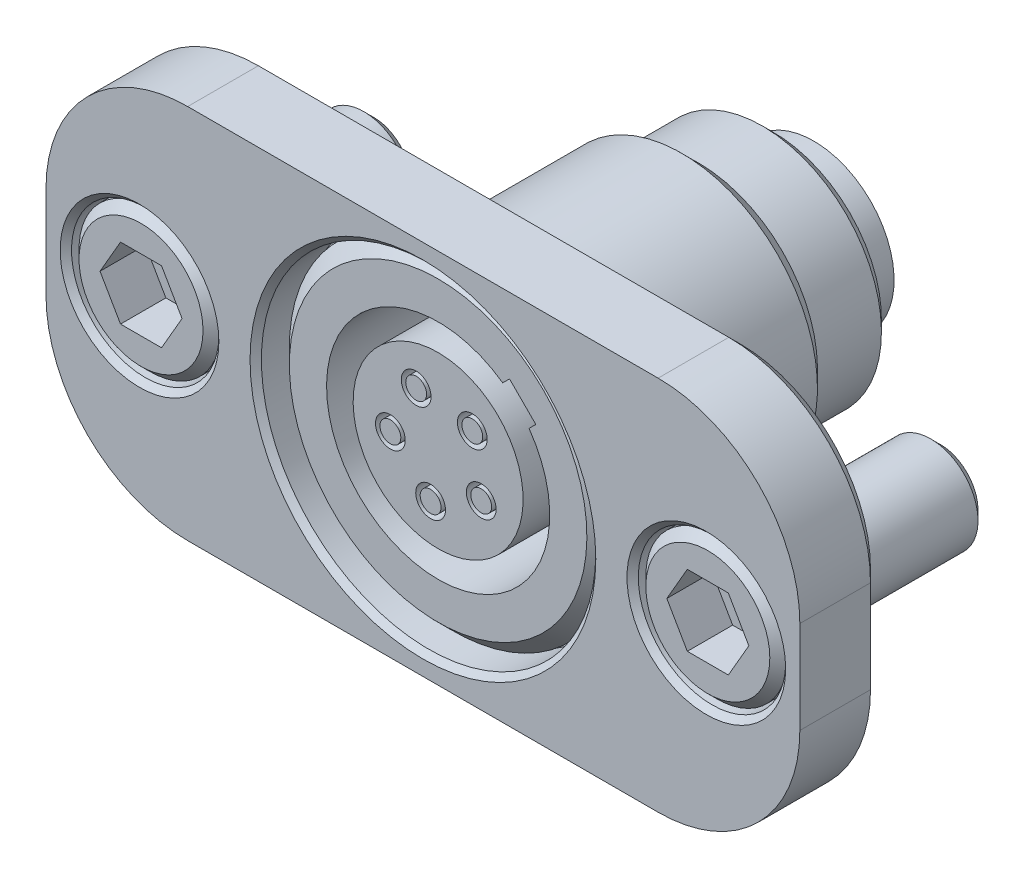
ISO-10303-21;
HEADER;
FILE_DESCRIPTION(('STEP AP214'),'2;1');
FILE_NAME('part.step','',(''),(''),'','','');
FILE_SCHEMA(('AUTOMOTIVE_DESIGN { 1 0 10303 214 1 1 1 1 }'));
ENDSEC;
DATA;
#1=APPLICATION_CONTEXT('core data for automotive mechanical design processes');
#2=APPLICATION_PROTOCOL_DEFINITION('international standard','automotive_design',2000,#1);
#3=PRODUCT_CONTEXT('',#1,'mechanical');
#4=PRODUCT('Part','Part','',(#3));
#5=PRODUCT_RELATED_PRODUCT_CATEGORY('part','',(#4));
#6=PRODUCT_DEFINITION_FORMATION('','',#4);
#7=PRODUCT_DEFINITION_CONTEXT('part definition',#1,'design');
#8=PRODUCT_DEFINITION('design','',#6,#7);
#9=PRODUCT_DEFINITION_SHAPE('','',#8);
#10=(LENGTH_UNIT() NAMED_UNIT(*) SI_UNIT(.MILLI.,.METRE.));
#11=(NAMED_UNIT(*) PLANE_ANGLE_UNIT() SI_UNIT($,.RADIAN.));
#12=(NAMED_UNIT(*) SI_UNIT($,.STERADIAN.) SOLID_ANGLE_UNIT());
#13=UNCERTAINTY_MEASURE_WITH_UNIT(LENGTH_MEASURE(1.E-05),#10,'distance_accuracy_value','');
#14=(GEOMETRIC_REPRESENTATION_CONTEXT(3) GLOBAL_UNCERTAINTY_ASSIGNED_CONTEXT((#13)) GLOBAL_UNIT_ASSIGNED_CONTEXT((#10,
#11,#12)) REPRESENTATION_CONTEXT('',''));
#15=CARTESIAN_POINT('',(0.,0.,0.));
#16=DIRECTION('',(0.,0.,1.));
#17=DIRECTION('',(1.,0.,0.));
#18=AXIS2_PLACEMENT_3D('',#15,#16,#17);
#19=CARTESIAN_POINT('',(19.05,0.,-0.1016));
#20=DIRECTION('',(0.,0.,-1.));
#21=DIRECTION('',(-1.,0.,0.));
#22=AXIS2_PLACEMENT_3D('',#19,#20,#21);
#23=CYLINDRICAL_SURFACE('',#22,4.7625);
#24=CARTESIAN_POINT('',(19.05,0.,-3.0226));
#25=DIRECTION('',(0.,0.,-1.));
#26=DIRECTION('',(1.,0.,0.));
#27=AXIS2_PLACEMENT_3D('',#24,#25,#26);
#28=CIRCLE('',#27,4.7625);
#29=CARTESIAN_POINT('',(23.8125,0.,-3.0226));
#30=VERTEX_POINT('',#29);
#31=EDGE_CURVE('P0_E81',#30,#30,#28,.T.);
#32=ORIENTED_EDGE('',*,*,#31,.F.);
#33=EDGE_LOOP('',(#32));
#34=FACE_BOUND('',#33,.T.);
#35=CARTESIAN_POINT('',(19.05,0.,-0.6969125));
#36=DIRECTION('',(0.,0.,1.));
#37=DIRECTION('',(1.,0.,0.));
#38=AXIS2_PLACEMENT_3D('',#35,#36,#37);
#39=CIRCLE('',#38,4.7625);
#40=CARTESIAN_POINT('',(23.8125,0.,-0.6969125));
#41=VERTEX_POINT('',#40);
#42=EDGE_CURVE('P0_E423',#41,#41,#39,.T.);
#43=ORIENTED_EDGE('',*,*,#42,.F.);
#44=EDGE_LOOP('',(#43));
#45=FACE_BOUND('',#44,.T.);
#46=ADVANCED_FACE('P0_F16',(#34,#45),#23,.T.);
#47=CARTESIAN_POINT('',(19.05,0.,-15.7226));
#48=DIRECTION('',(0.,0.,1.));
#49=DIRECTION('',(1.,0.,0.));
#50=AXIS2_PLACEMENT_3D('',#47,#48,#49);
#51=CYLINDRICAL_SURFACE('',#50,3.175);
#52=CARTESIAN_POINT('',(19.05,0.,-3.3782));
#53=DIRECTION('',(0.,0.,-1.));
#54=DIRECTION('',(-1.,0.,0.));
#55=AXIS2_PLACEMENT_3D('',#52,#53,#54);
#56=CIRCLE('',#55,3.175);
#57=CARTESIAN_POINT('',(15.875,0.,-3.3782));
#58=VERTEX_POINT('',#57);
#59=EDGE_CURVE('P0_E24',#58,#58,#56,.T.);
#60=ORIENTED_EDGE('',*,*,#59,.T.);
#61=EDGE_LOOP('',(#60));
#62=FACE_BOUND('',#61,.T.);
#63=CARTESIAN_POINT('',(19.05,0.,-15.0876));
#64=DIRECTION('',(0.,0.,-1.));
#65=DIRECTION('',(-1.,0.,0.));
#66=AXIS2_PLACEMENT_3D('',#63,#64,#65);
#67=CIRCLE('',#66,3.175);
#68=CARTESIAN_POINT('',(15.875,0.,-15.0876));
#69=VERTEX_POINT('',#68);
#70=EDGE_CURVE('P0_E144',#69,#69,#67,.F.);
#71=ORIENTED_EDGE('',*,*,#70,.T.);
#72=EDGE_LOOP('',(#71));
#73=FACE_BOUND('',#72,.T.);
#74=ADVANCED_FACE('P0_F18',(#62,#73),#51,.T.);
#75=CARTESIAN_POINT('',(19.05,0.,-15.7226));
#76=DIRECTION('',(0.,0.,-1.));
#77=DIRECTION('',(-1.,0.,0.));
#78=AXIS2_PLACEMENT_3D('',#75,#76,#77);
#79=PLANE('',#78);
#80=CARTESIAN_POINT('',(19.05,0.,-15.7226));
#81=DIRECTION('',(0.,0.,-1.));
#82=DIRECTION('',(-1.,0.,0.));
#83=AXIS2_PLACEMENT_3D('',#80,#81,#82);
#84=CIRCLE('',#83,2.54);
#85=CARTESIAN_POINT('',(16.51,0.,-15.7226));
#86=VERTEX_POINT('',#85);
#87=EDGE_CURVE('P0_E141',#86,#86,#84,.T.);
#88=ORIENTED_EDGE('',*,*,#87,.T.);
#89=EDGE_LOOP('',(#88));
#90=FACE_BOUND('',#89,.T.);
#91=ADVANCED_FACE('P0_F168',(#90),#79,.T.);
#92=CARTESIAN_POINT('',(19.05,0.,-3.0226));
#93=DIRECTION('',(0.,0.,-1.));
#94=DIRECTION('',(-1.,0.,0.));
#95=AXIS2_PLACEMENT_3D('',#92,#93,#94);
#96=PLANE('',#95);
#97=CARTESIAN_POINT('',(19.05,0.,-3.0226));
#98=DIRECTION('',(0.,0.,-1.));
#99=DIRECTION('',(-1.,0.,0.));
#100=AXIS2_PLACEMENT_3D('',#97,#98,#99);
#101=CIRCLE('',#100,3.5306);
#102=CARTESIAN_POINT('',(15.5194,0.,-3.0226));
#103=VERTEX_POINT('',#102);
#104=EDGE_CURVE('P0_E11',#103,#103,#101,.F.);
#105=ORIENTED_EDGE('',*,*,#104,.T.);
#106=EDGE_LOOP('',(#105));
#107=FACE_BOUND('',#106,.T.);
#108=ORIENTED_EDGE('',*,*,#31,.T.);
#109=EDGE_LOOP('',(#108));
#110=FACE_BOUND('',#109,.T.);
#111=ADVANCED_FACE('P0_F173',(#107,#110),#96,.T.);
#112=CARTESIAN_POINT('',(19.05,0.,-15.7226));
#113=DIRECTION('',(0.,0.,1.));
#114=DIRECTION('',(1.,0.,0.));
#115=AXIS2_PLACEMENT_3D('',#112,#113,#114);
#116=CONICAL_SURFACE('',#115,2.54,0.785398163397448);
#117=ORIENTED_EDGE('',*,*,#70,.F.);
#118=EDGE_LOOP('',(#117));
#119=FACE_BOUND('',#118,.T.);
#120=ORIENTED_EDGE('',*,*,#87,.F.);
#121=EDGE_LOOP('',(#120));
#122=FACE_BOUND('',#121,.T.);
#123=ADVANCED_FACE('P0_F178',(#119,#122),#116,.T.);
#124=CARTESIAN_POINT('',(19.05,0.,-0.1016));
#125=DIRECTION('',(0.,0.,-1.));
#126=DIRECTION('',(-1.,0.,0.));
#127=AXIS2_PLACEMENT_3D('',#124,#125,#126);
#128=CONICAL_SURFACE('',#127,4.1671875,0.785398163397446);
#129=ORIENTED_EDGE('',*,*,#42,.T.);
#130=EDGE_LOOP('',(#129));
#131=FACE_BOUND('',#130,.T.);
#132=CARTESIAN_POINT('',(19.05,0.,-0.1016));
#133=DIRECTION('',(0.,0.,1.));
#134=DIRECTION('',(1.,0.,0.));
#135=AXIS2_PLACEMENT_3D('',#132,#133,#134);
#136=CIRCLE('',#135,4.1671875);
#137=CARTESIAN_POINT('',(23.2171875,0.,-0.1016));
#138=VERTEX_POINT('',#137);
#139=EDGE_CURVE('P0_E90',#138,#138,#136,.T.);
#140=ORIENTED_EDGE('',*,*,#139,.F.);
#141=EDGE_LOOP('',(#140));
#142=FACE_BOUND('',#141,.T.);
#143=ADVANCED_FACE('P0_F183',(#131,#142),#128,.T.);
#144=CARTESIAN_POINT('',(19.05,-4.7752,-3.1496));
#145=DIRECTION('',(0.,0.,1.));
#146=DIRECTION('',(1.,0.,0.));
#147=AXIS2_PLACEMENT_3D('',#144,#145,#146);
#148=PLANE('',#147);
#149=DIRECTION('',(0.5,-0.866025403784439,0.));
#150=VECTOR('',#149,1.);
#151=CARTESIAN_POINT('',(16.2930369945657,0.,-3.1496));
#152=LINE('',#151,#150);
#153=CARTESIAN_POINT('',(16.2930369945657,0.,-3.1496));
#154=VERTEX_POINT('',#153);
#155=CARTESIAN_POINT('',(17.6715184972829,-2.3876,-3.1496));
#156=VERTEX_POINT('',#155);
#157=EDGE_CURVE('P0_E115',#154,#156,#152,.T.);
#158=ORIENTED_EDGE('',*,*,#157,.T.);
#159=DIRECTION('',(1.,0.,0.));
#160=VECTOR('',#159,1.);
#161=CARTESIAN_POINT('',(17.6715184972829,-2.3876,-3.1496));
#162=LINE('',#161,#160);
#163=CARTESIAN_POINT('',(20.4284815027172,-2.3876,-3.1496));
#164=VERTEX_POINT('',#163);
#165=EDGE_CURVE('P0_E77',#156,#164,#162,.T.);
#166=ORIENTED_EDGE('',*,*,#165,.T.);
#167=DIRECTION('',(0.5,0.866025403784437,0.));
#168=VECTOR('',#167,1.);
#169=CARTESIAN_POINT('',(20.4284815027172,-2.3876,-3.1496));
#170=LINE('',#169,#168);
#171=CARTESIAN_POINT('',(21.8069630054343,0.,-3.1496));
#172=VERTEX_POINT('',#171);
#173=EDGE_CURVE('P0_E118',#164,#172,#170,.T.);
#174=ORIENTED_EDGE('',*,*,#173,.T.);
#175=DIRECTION('',(-0.5,0.866025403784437,0.));
#176=VECTOR('',#175,1.);
#177=CARTESIAN_POINT('',(21.8069630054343,0.,-3.1496));
#178=LINE('',#177,#176);
#179=CARTESIAN_POINT('',(20.4284815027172,2.3876,-3.1496));
#180=VERTEX_POINT('',#179);
#181=EDGE_CURVE('P0_E121',#172,#180,#178,.T.);
#182=ORIENTED_EDGE('',*,*,#181,.T.);
#183=DIRECTION('',(-1.,0.,0.));
#184=VECTOR('',#183,1.);
#185=CARTESIAN_POINT('',(20.4284815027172,2.3876,-3.1496));
#186=LINE('',#185,#184);
#187=CARTESIAN_POINT('',(17.6715184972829,2.3876,-3.1496));
#188=VERTEX_POINT('',#187);
#189=EDGE_CURVE('P0_E124',#180,#188,#186,.T.);
#190=ORIENTED_EDGE('',*,*,#189,.T.);
#191=DIRECTION('',(-0.5,-0.866025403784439,0.));
#192=VECTOR('',#191,1.);
#193=CARTESIAN_POINT('',(17.6715184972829,2.3876,-3.1496));
#194=LINE('',#193,#192);
#195=EDGE_CURVE('P0_E127',#188,#154,#194,.T.);
#196=ORIENTED_EDGE('',*,*,#195,.T.);
#197=EDGE_LOOP('',(#158,#166,#174,#182,#190,#196));
#198=FACE_BOUND('',#197,.T.);
#199=ADVANCED_FACE('P0_F189',(#198),#148,.T.);
#200=CARTESIAN_POINT('',(20.4284815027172,-2.3876,-3.1496));
#201=DIRECTION('',(0.866025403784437,-0.5,0.));
#202=DIRECTION('',(0.5,0.866025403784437,0.));
#203=AXIS2_PLACEMENT_3D('',#200,#201,#202);
#204=PLANE('',#203);
#205=DIRECTION('',(0.5,0.866025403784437,0.));
#206=VECTOR('',#205,1.);
#207=CARTESIAN_POINT('',(20.4284815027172,-2.3876,-0.1016));
#208=LINE('',#207,#206);
#209=CARTESIAN_POINT('',(20.4284815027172,-2.3876,-0.1016));
#210=VERTEX_POINT('',#209);
#211=CARTESIAN_POINT('',(21.8069630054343,0.,-0.1016));
#212=VERTEX_POINT('',#211);
#213=EDGE_CURVE('P0_E96',#210,#212,#208,.T.);
#214=ORIENTED_EDGE('',*,*,#213,.T.);
#215=DIRECTION('',(0.,0.,1.));
#216=VECTOR('',#215,1.);
#217=CARTESIAN_POINT('',(21.8069630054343,0.,-3.1496));
#218=LINE('',#217,#216);
#219=EDGE_CURVE('P0_E135',#172,#212,#218,.T.);
#220=ORIENTED_EDGE('',*,*,#219,.F.);
#221=ORIENTED_EDGE('',*,*,#173,.F.);
#222=DIRECTION('',(0.,0.,1.));
#223=VECTOR('',#222,1.);
#224=CARTESIAN_POINT('',(20.4284815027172,-2.3876,-3.1496));
#225=LINE('',#224,#223);
#226=EDGE_CURVE('P0_E82',#164,#210,#225,.T.);
#227=ORIENTED_EDGE('',*,*,#226,.T.);
#228=EDGE_LOOP('',(#214,#220,#221,#227));
#229=FACE_BOUND('',#228,.T.);
#230=ADVANCED_FACE('P0_F195',(#229),#204,.F.);
#231=CARTESIAN_POINT('',(21.8069630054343,0.,-3.1496));
#232=DIRECTION('',(0.866025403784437,0.5,0.));
#233=DIRECTION('',(-0.5,0.866025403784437,0.));
#234=AXIS2_PLACEMENT_3D('',#231,#232,#233);
#235=PLANE('',#234);
#236=DIRECTION('',(-0.5,0.866025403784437,0.));
#237=VECTOR('',#236,1.);
#238=CARTESIAN_POINT('',(21.8069630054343,0.,-0.1016));
#239=LINE('',#238,#237);
#240=CARTESIAN_POINT('',(20.4284815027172,2.3876,-0.1016));
#241=VERTEX_POINT('',#240);
#242=EDGE_CURVE('P0_E103',#212,#241,#239,.T.);
#243=ORIENTED_EDGE('',*,*,#242,.T.);
#244=DIRECTION('',(0.,0.,1.));
#245=VECTOR('',#244,1.);
#246=CARTESIAN_POINT('',(20.4284815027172,2.3876,-3.1496));
#247=LINE('',#246,#245);
#248=EDGE_CURVE('P0_E133',#180,#241,#247,.T.);
#249=ORIENTED_EDGE('',*,*,#248,.F.);
#250=ORIENTED_EDGE('',*,*,#181,.F.);
#251=ORIENTED_EDGE('',*,*,#219,.T.);
#252=EDGE_LOOP('',(#243,#249,#250,#251));
#253=FACE_BOUND('',#252,.T.);
#254=ADVANCED_FACE('P0_F203',(#253),#235,.F.);
#255=CARTESIAN_POINT('',(20.4284815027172,2.3876,-3.1496));
#256=DIRECTION('',(0.,1.,0.));
#257=DIRECTION('',(0.,0.,1.));
#258=AXIS2_PLACEMENT_3D('',#255,#256,#257);
#259=PLANE('',#258);
#260=DIRECTION('',(-1.,0.,0.));
#261=VECTOR('',#260,1.);
#262=CARTESIAN_POINT('',(20.4284815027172,2.3876,-0.1016));
#263=LINE('',#262,#261);
#264=CARTESIAN_POINT('',(17.6715184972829,2.3876,-0.1016));
#265=VERTEX_POINT('',#264);
#266=EDGE_CURVE('P0_E31',#241,#265,#263,.T.);
#267=ORIENTED_EDGE('',*,*,#266,.T.);
#268=DIRECTION('',(0.,0.,1.));
#269=VECTOR('',#268,1.);
#270=CARTESIAN_POINT('',(17.6715184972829,2.3876,-3.1496));
#271=LINE('',#270,#269);
#272=EDGE_CURVE('P0_E131',#188,#265,#271,.T.);
#273=ORIENTED_EDGE('',*,*,#272,.F.);
#274=ORIENTED_EDGE('',*,*,#189,.F.);
#275=ORIENTED_EDGE('',*,*,#248,.T.);
#276=EDGE_LOOP('',(#267,#273,#274,#275));
#277=FACE_BOUND('',#276,.T.);
#278=ADVANCED_FACE('P0_F200',(#277),#259,.F.);
#279=CARTESIAN_POINT('',(17.6715184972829,2.3876,-3.1496));
#280=DIRECTION('',(-0.866025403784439,0.5,0.));
#281=DIRECTION('',(-0.5,-0.866025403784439,0.));
#282=AXIS2_PLACEMENT_3D('',#279,#280,#281);
#283=PLANE('',#282);
#284=DIRECTION('',(-0.5,-0.866025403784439,0.));
#285=VECTOR('',#284,1.);
#286=CARTESIAN_POINT('',(17.6715184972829,2.3876,-0.1016));
#287=LINE('',#286,#285);
#288=CARTESIAN_POINT('',(16.2930369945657,0.,-0.1016));
#289=VERTEX_POINT('',#288);
#290=EDGE_CURVE('P0_E113',#265,#289,#287,.T.);
#291=ORIENTED_EDGE('',*,*,#290,.T.);
#292=DIRECTION('',(0.,0.,1.));
#293=VECTOR('',#292,1.);
#294=CARTESIAN_POINT('',(16.2930369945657,0.,-3.1496));
#295=LINE('',#294,#293);
#296=EDGE_CURVE('P0_E39',#154,#289,#295,.T.);
#297=ORIENTED_EDGE('',*,*,#296,.F.);
#298=ORIENTED_EDGE('',*,*,#195,.F.);
#299=ORIENTED_EDGE('',*,*,#272,.T.);
#300=EDGE_LOOP('',(#291,#297,#298,#299));
#301=FACE_BOUND('',#300,.T.);
#302=ADVANCED_FACE('P0_F197',(#301),#283,.F.);
#303=CARTESIAN_POINT('',(16.2930369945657,0.,-3.1496));
#304=DIRECTION('',(-0.866025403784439,-0.5,0.));
#305=DIRECTION('',(0.5,-0.866025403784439,0.));
#306=AXIS2_PLACEMENT_3D('',#303,#304,#305);
#307=PLANE('',#306);
#308=DIRECTION('',(0.5,-0.866025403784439,0.));
#309=VECTOR('',#308,1.);
#310=CARTESIAN_POINT('',(16.2930369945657,0.,-0.1016));
#311=LINE('',#310,#309);
#312=CARTESIAN_POINT('',(17.6715184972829,-2.3876,-0.1016));
#313=VERTEX_POINT('',#312);
#314=EDGE_CURVE('P0_E85',#289,#313,#311,.T.);
#315=ORIENTED_EDGE('',*,*,#314,.T.);
#316=DIRECTION('',(0.,0.,1.));
#317=VECTOR('',#316,1.);
#318=CARTESIAN_POINT('',(17.6715184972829,-2.3876,-3.1496));
#319=LINE('',#318,#317);
#320=EDGE_CURVE('P0_E70',#156,#313,#319,.T.);
#321=ORIENTED_EDGE('',*,*,#320,.F.);
#322=ORIENTED_EDGE('',*,*,#157,.F.);
#323=ORIENTED_EDGE('',*,*,#296,.T.);
#324=EDGE_LOOP('',(#315,#321,#322,#323));
#325=FACE_BOUND('',#324,.T.);
#326=ADVANCED_FACE('P0_F86',(#325),#307,.F.);
#327=CARTESIAN_POINT('',(17.6715184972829,-2.3876,-3.1496));
#328=DIRECTION('',(0.,-1.,0.));
#329=DIRECTION('',(0.,0.,-1.));
#330=AXIS2_PLACEMENT_3D('',#327,#328,#329);
#331=PLANE('',#330);
#332=DIRECTION('',(1.,0.,0.));
#333=VECTOR('',#332,1.);
#334=CARTESIAN_POINT('',(17.6715184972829,-2.3876,-0.1016));
#335=LINE('',#334,#333);
#336=EDGE_CURVE('P0_E74',#313,#210,#335,.T.);
#337=ORIENTED_EDGE('',*,*,#336,.T.);
#338=ORIENTED_EDGE('',*,*,#226,.F.);
#339=ORIENTED_EDGE('',*,*,#165,.F.);
#340=ORIENTED_EDGE('',*,*,#320,.T.);
#341=EDGE_LOOP('',(#337,#338,#339,#340));
#342=FACE_BOUND('',#341,.T.);
#343=ADVANCED_FACE('P0_F72',(#342),#331,.F.);
#344=CARTESIAN_POINT('',(19.05,0.,-0.1016));
#345=DIRECTION('',(0.,0.,-1.));
#346=DIRECTION('',(-1.,0.,0.));
#347=AXIS2_PLACEMENT_3D('',#344,#345,#346);
#348=PLANE('',#347);
#349=ORIENTED_EDGE('',*,*,#336,.F.);
#350=ORIENTED_EDGE('',*,*,#314,.F.);
#351=ORIENTED_EDGE('',*,*,#290,.F.);
#352=ORIENTED_EDGE('',*,*,#266,.F.);
#353=ORIENTED_EDGE('',*,*,#242,.F.);
#354=ORIENTED_EDGE('',*,*,#213,.F.);
#355=EDGE_LOOP('',(#349,#350,#351,#352,#353,#354));
#356=FACE_BOUND('',#355,.T.);
#357=ORIENTED_EDGE('',*,*,#139,.T.);
#358=EDGE_LOOP('',(#357));
#359=FACE_BOUND('',#358,.T.);
#360=ADVANCED_FACE('P0_F92',(#356,#359),#348,.F.);
#361=CARTESIAN_POINT('',(19.05,0.,-3.3782));
#362=DIRECTION('',(0.,0.,-1.));
#363=DIRECTION('',(-1.,0.,0.));
#364=AXIS2_PLACEMENT_3D('',#361,#362,#363);
#365=TOROIDAL_SURFACE('',#364,3.5306,0.3556);
#366=ORIENTED_EDGE('',*,*,#104,.F.);
#367=EDGE_LOOP('',(#366));
#368=FACE_BOUND('',#367,.T.);
#369=ORIENTED_EDGE('',*,*,#59,.F.);
#370=EDGE_LOOP('',(#369));
#371=FACE_BOUND('',#370,.T.);
#372=ADVANCED_FACE('P0_F151',(#368,#371),#365,.F.);
#373=CLOSED_SHELL('',(#46,#74,#91,#111,#123,#143,#199,#230,#254,#278,#302,#326,#343,#360,#372));
#374=MANIFOLD_SOLID_BREP('P0_B1',#373);
#375=CARTESIAN_POINT('',(-19.05,0.,-0.1016));
#376=DIRECTION('',(0.,0.,-1.));
#377=DIRECTION('',(-1.,0.,0.));
#378=AXIS2_PLACEMENT_3D('',#375,#376,#377);
#379=CYLINDRICAL_SURFACE('',#378,4.7625);
#380=CARTESIAN_POINT('',(-19.05,0.,-3.0226));
#381=DIRECTION('',(0.,0.,-1.));
#382=DIRECTION('',(1.,0.,0.));
#383=AXIS2_PLACEMENT_3D('',#380,#381,#382);
#384=CIRCLE('',#383,4.7625);
#385=CARTESIAN_POINT('',(-14.2875,0.,-3.0226));
#386=VERTEX_POINT('',#385);
#387=EDGE_CURVE('P1_E81',#386,#386,#384,.T.);
#388=ORIENTED_EDGE('',*,*,#387,.F.);
#389=EDGE_LOOP('',(#388));
#390=FACE_BOUND('',#389,.T.);
#391=CARTESIAN_POINT('',(-19.05,0.,-0.6969125));
#392=DIRECTION('',(0.,0.,1.));
#393=DIRECTION('',(1.,0.,0.));
#394=AXIS2_PLACEMENT_3D('',#391,#392,#393);
#395=CIRCLE('',#394,4.7625);
#396=CARTESIAN_POINT('',(-14.2875,0.,-0.6969125));
#397=VERTEX_POINT('',#396);
#398=EDGE_CURVE('P1_E423',#397,#397,#395,.T.);
#399=ORIENTED_EDGE('',*,*,#398,.F.);
#400=EDGE_LOOP('',(#399));
#401=FACE_BOUND('',#400,.T.);
#402=ADVANCED_FACE('P1_F16',(#390,#401),#379,.T.);
#403=CARTESIAN_POINT('',(-19.05,0.,-15.7226));
#404=DIRECTION('',(0.,0.,1.));
#405=DIRECTION('',(1.,0.,0.));
#406=AXIS2_PLACEMENT_3D('',#403,#404,#405);
#407=CYLINDRICAL_SURFACE('',#406,3.175);
#408=CARTESIAN_POINT('',(-19.05,0.,-3.3782));
#409=DIRECTION('',(0.,0.,-1.));
#410=DIRECTION('',(-1.,0.,0.));
#411=AXIS2_PLACEMENT_3D('',#408,#409,#410);
#412=CIRCLE('',#411,3.175);
#413=CARTESIAN_POINT('',(-22.225,0.,-3.3782));
#414=VERTEX_POINT('',#413);
#415=EDGE_CURVE('P1_E24',#414,#414,#412,.T.);
#416=ORIENTED_EDGE('',*,*,#415,.T.);
#417=EDGE_LOOP('',(#416));
#418=FACE_BOUND('',#417,.T.);
#419=CARTESIAN_POINT('',(-19.05,0.,-15.0876));
#420=DIRECTION('',(0.,0.,-1.));
#421=DIRECTION('',(-1.,0.,0.));
#422=AXIS2_PLACEMENT_3D('',#419,#420,#421);
#423=CIRCLE('',#422,3.175);
#424=CARTESIAN_POINT('',(-22.225,0.,-15.0876));
#425=VERTEX_POINT('',#424);
#426=EDGE_CURVE('P1_E144',#425,#425,#423,.F.);
#427=ORIENTED_EDGE('',*,*,#426,.T.);
#428=EDGE_LOOP('',(#427));
#429=FACE_BOUND('',#428,.T.);
#430=ADVANCED_FACE('P1_F18',(#418,#429),#407,.T.);
#431=CARTESIAN_POINT('',(-19.05,0.,-15.7226));
#432=DIRECTION('',(0.,0.,-1.));
#433=DIRECTION('',(-1.,0.,0.));
#434=AXIS2_PLACEMENT_3D('',#431,#432,#433);
#435=PLANE('',#434);
#436=CARTESIAN_POINT('',(-19.05,0.,-15.7226));
#437=DIRECTION('',(0.,0.,-1.));
#438=DIRECTION('',(-1.,0.,0.));
#439=AXIS2_PLACEMENT_3D('',#436,#437,#438);
#440=CIRCLE('',#439,2.54);
#441=CARTESIAN_POINT('',(-21.59,0.,-15.7226));
#442=VERTEX_POINT('',#441);
#443=EDGE_CURVE('P1_E141',#442,#442,#440,.T.);
#444=ORIENTED_EDGE('',*,*,#443,.T.);
#445=EDGE_LOOP('',(#444));
#446=FACE_BOUND('',#445,.T.);
#447=ADVANCED_FACE('P1_F168',(#446),#435,.T.);
#448=CARTESIAN_POINT('',(-19.05,0.,-3.0226));
#449=DIRECTION('',(0.,0.,-1.));
#450=DIRECTION('',(-1.,0.,0.));
#451=AXIS2_PLACEMENT_3D('',#448,#449,#450);
#452=PLANE('',#451);
#453=CARTESIAN_POINT('',(-19.05,0.,-3.0226));
#454=DIRECTION('',(0.,0.,-1.));
#455=DIRECTION('',(-1.,0.,0.));
#456=AXIS2_PLACEMENT_3D('',#453,#454,#455);
#457=CIRCLE('',#456,3.5306);
#458=CARTESIAN_POINT('',(-22.5806,0.,-3.0226));
#459=VERTEX_POINT('',#458);
#460=EDGE_CURVE('P1_E11',#459,#459,#457,.F.);
#461=ORIENTED_EDGE('',*,*,#460,.T.);
#462=EDGE_LOOP('',(#461));
#463=FACE_BOUND('',#462,.T.);
#464=ORIENTED_EDGE('',*,*,#387,.T.);
#465=EDGE_LOOP('',(#464));
#466=FACE_BOUND('',#465,.T.);
#467=ADVANCED_FACE('P1_F173',(#463,#466),#452,.T.);
#468=CARTESIAN_POINT('',(-19.05,0.,-15.7226));
#469=DIRECTION('',(0.,0.,1.));
#470=DIRECTION('',(1.,0.,0.));
#471=AXIS2_PLACEMENT_3D('',#468,#469,#470);
#472=CONICAL_SURFACE('',#471,2.54,0.785398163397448);
#473=ORIENTED_EDGE('',*,*,#426,.F.);
#474=EDGE_LOOP('',(#473));
#475=FACE_BOUND('',#474,.T.);
#476=ORIENTED_EDGE('',*,*,#443,.F.);
#477=EDGE_LOOP('',(#476));
#478=FACE_BOUND('',#477,.T.);
#479=ADVANCED_FACE('P1_F178',(#475,#478),#472,.T.);
#480=CARTESIAN_POINT('',(-19.05,0.,-0.1016));
#481=DIRECTION('',(0.,0.,-1.));
#482=DIRECTION('',(-1.,0.,0.));
#483=AXIS2_PLACEMENT_3D('',#480,#481,#482);
#484=CONICAL_SURFACE('',#483,4.1671875,0.785398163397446);
#485=ORIENTED_EDGE('',*,*,#398,.T.);
#486=EDGE_LOOP('',(#485));
#487=FACE_BOUND('',#486,.T.);
#488=CARTESIAN_POINT('',(-19.05,0.,-0.1016));
#489=DIRECTION('',(0.,0.,1.));
#490=DIRECTION('',(1.,0.,0.));
#491=AXIS2_PLACEMENT_3D('',#488,#489,#490);
#492=CIRCLE('',#491,4.1671875);
#493=CARTESIAN_POINT('',(-14.8828125,0.,-0.1016));
#494=VERTEX_POINT('',#493);
#495=EDGE_CURVE('P1_E90',#494,#494,#492,.T.);
#496=ORIENTED_EDGE('',*,*,#495,.F.);
#497=EDGE_LOOP('',(#496));
#498=FACE_BOUND('',#497,.T.);
#499=ADVANCED_FACE('P1_F183',(#487,#498),#484,.T.);
#500=CARTESIAN_POINT('',(-19.05,-4.7752,-3.1496));
#501=DIRECTION('',(0.,0.,1.));
#502=DIRECTION('',(1.,0.,0.));
#503=AXIS2_PLACEMENT_3D('',#500,#501,#502);
#504=PLANE('',#503);
#505=DIRECTION('',(0.5,-0.866025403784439,0.));
#506=VECTOR('',#505,1.);
#507=CARTESIAN_POINT('',(-21.8069630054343,0.,-3.1496));
#508=LINE('',#507,#506);
#509=CARTESIAN_POINT('',(-21.8069630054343,0.,-3.1496));
#510=VERTEX_POINT('',#509);
#511=CARTESIAN_POINT('',(-20.4284815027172,-2.3876,-3.1496));
#512=VERTEX_POINT('',#511);
#513=EDGE_CURVE('P1_E115',#510,#512,#508,.T.);
#514=ORIENTED_EDGE('',*,*,#513,.T.);
#515=DIRECTION('',(1.,0.,0.));
#516=VECTOR('',#515,1.);
#517=CARTESIAN_POINT('',(-20.4284815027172,-2.3876,-3.1496));
#518=LINE('',#517,#516);
#519=CARTESIAN_POINT('',(-17.6715184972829,-2.3876,-3.1496));
#520=VERTEX_POINT('',#519);
#521=EDGE_CURVE('P1_E77',#512,#520,#518,.T.);
#522=ORIENTED_EDGE('',*,*,#521,.T.);
#523=DIRECTION('',(0.5,0.866025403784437,0.));
#524=VECTOR('',#523,1.);
#525=CARTESIAN_POINT('',(-17.6715184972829,-2.3876,-3.1496));
#526=LINE('',#525,#524);
#527=CARTESIAN_POINT('',(-16.2930369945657,0.,-3.1496));
#528=VERTEX_POINT('',#527);
#529=EDGE_CURVE('P1_E118',#520,#528,#526,.T.);
#530=ORIENTED_EDGE('',*,*,#529,.T.);
#531=DIRECTION('',(-0.5,0.866025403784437,0.));
#532=VECTOR('',#531,1.);
#533=CARTESIAN_POINT('',(-16.2930369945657,0.,-3.1496));
#534=LINE('',#533,#532);
#535=CARTESIAN_POINT('',(-17.6715184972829,2.3876,-3.1496));
#536=VERTEX_POINT('',#535);
#537=EDGE_CURVE('P1_E121',#528,#536,#534,.T.);
#538=ORIENTED_EDGE('',*,*,#537,.T.);
#539=DIRECTION('',(-1.,0.,0.));
#540=VECTOR('',#539,1.);
#541=CARTESIAN_POINT('',(-17.6715184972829,2.3876,-3.1496));
#542=LINE('',#541,#540);
#543=CARTESIAN_POINT('',(-20.4284815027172,2.3876,-3.1496));
#544=VERTEX_POINT('',#543);
#545=EDGE_CURVE('P1_E124',#536,#544,#542,.T.);
#546=ORIENTED_EDGE('',*,*,#545,.T.);
#547=DIRECTION('',(-0.5,-0.866025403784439,0.));
#548=VECTOR('',#547,1.);
#549=CARTESIAN_POINT('',(-20.4284815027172,2.3876,-3.1496));
#550=LINE('',#549,#548);
#551=EDGE_CURVE('P1_E127',#544,#510,#550,.T.);
#552=ORIENTED_EDGE('',*,*,#551,.T.);
#553=EDGE_LOOP('',(#514,#522,#530,#538,#546,#552));
#554=FACE_BOUND('',#553,.T.);
#555=ADVANCED_FACE('P1_F189',(#554),#504,.T.);
#556=CARTESIAN_POINT('',(-17.6715184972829,-2.3876,-3.1496));
#557=DIRECTION('',(0.866025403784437,-0.5,0.));
#558=DIRECTION('',(0.5,0.866025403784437,0.));
#559=AXIS2_PLACEMENT_3D('',#556,#557,#558);
#560=PLANE('',#559);
#561=DIRECTION('',(0.5,0.866025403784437,0.));
#562=VECTOR('',#561,1.);
#563=CARTESIAN_POINT('',(-17.6715184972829,-2.3876,-0.1016));
#564=LINE('',#563,#562);
#565=CARTESIAN_POINT('',(-17.6715184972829,-2.3876,-0.1016));
#566=VERTEX_POINT('',#565);
#567=CARTESIAN_POINT('',(-16.2930369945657,0.,-0.1016));
#568=VERTEX_POINT('',#567);
#569=EDGE_CURVE('P1_E96',#566,#568,#564,.T.);
#570=ORIENTED_EDGE('',*,*,#569,.T.);
#571=DIRECTION('',(0.,0.,1.));
#572=VECTOR('',#571,1.);
#573=CARTESIAN_POINT('',(-16.2930369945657,0.,-3.1496));
#574=LINE('',#573,#572);
#575=EDGE_CURVE('P1_E135',#528,#568,#574,.T.);
#576=ORIENTED_EDGE('',*,*,#575,.F.);
#577=ORIENTED_EDGE('',*,*,#529,.F.);
#578=DIRECTION('',(0.,0.,1.));
#579=VECTOR('',#578,1.);
#580=CARTESIAN_POINT('',(-17.6715184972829,-2.3876,-3.1496));
#581=LINE('',#580,#579);
#582=EDGE_CURVE('P1_E82',#520,#566,#581,.T.);
#583=ORIENTED_EDGE('',*,*,#582,.T.);
#584=EDGE_LOOP('',(#570,#576,#577,#583));
#585=FACE_BOUND('',#584,.T.);
#586=ADVANCED_FACE('P1_F195',(#585),#560,.F.);
#587=CARTESIAN_POINT('',(-16.2930369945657,0.,-3.1496));
#588=DIRECTION('',(0.866025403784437,0.5,0.));
#589=DIRECTION('',(-0.5,0.866025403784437,0.));
#590=AXIS2_PLACEMENT_3D('',#587,#588,#589);
#591=PLANE('',#590);
#592=DIRECTION('',(-0.5,0.866025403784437,0.));
#593=VECTOR('',#592,1.);
#594=CARTESIAN_POINT('',(-16.2930369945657,0.,-0.1016));
#595=LINE('',#594,#593);
#596=CARTESIAN_POINT('',(-17.6715184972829,2.3876,-0.1016));
#597=VERTEX_POINT('',#596);
#598=EDGE_CURVE('P1_E103',#568,#597,#595,.T.);
#599=ORIENTED_EDGE('',*,*,#598,.T.);
#600=DIRECTION('',(0.,0.,1.));
#601=VECTOR('',#600,1.);
#602=CARTESIAN_POINT('',(-17.6715184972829,2.3876,-3.1496));
#603=LINE('',#602,#601);
#604=EDGE_CURVE('P1_E133',#536,#597,#603,.T.);
#605=ORIENTED_EDGE('',*,*,#604,.F.);
#606=ORIENTED_EDGE('',*,*,#537,.F.);
#607=ORIENTED_EDGE('',*,*,#575,.T.);
#608=EDGE_LOOP('',(#599,#605,#606,#607));
#609=FACE_BOUND('',#608,.T.);
#610=ADVANCED_FACE('P1_F203',(#609),#591,.F.);
#611=CARTESIAN_POINT('',(-17.6715184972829,2.3876,-3.1496));
#612=DIRECTION('',(0.,1.,0.));
#613=DIRECTION('',(0.,0.,1.));
#614=AXIS2_PLACEMENT_3D('',#611,#612,#613);
#615=PLANE('',#614);
#616=DIRECTION('',(-1.,0.,0.));
#617=VECTOR('',#616,1.);
#618=CARTESIAN_POINT('',(-17.6715184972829,2.3876,-0.1016));
#619=LINE('',#618,#617);
#620=CARTESIAN_POINT('',(-20.4284815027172,2.3876,-0.1016));
#621=VERTEX_POINT('',#620);
#622=EDGE_CURVE('P1_E31',#597,#621,#619,.T.);
#623=ORIENTED_EDGE('',*,*,#622,.T.);
#624=DIRECTION('',(0.,0.,1.));
#625=VECTOR('',#624,1.);
#626=CARTESIAN_POINT('',(-20.4284815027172,2.3876,-3.1496));
#627=LINE('',#626,#625);
#628=EDGE_CURVE('P1_E131',#544,#621,#627,.T.);
#629=ORIENTED_EDGE('',*,*,#628,.F.);
#630=ORIENTED_EDGE('',*,*,#545,.F.);
#631=ORIENTED_EDGE('',*,*,#604,.T.);
#632=EDGE_LOOP('',(#623,#629,#630,#631));
#633=FACE_BOUND('',#632,.T.);
#634=ADVANCED_FACE('P1_F200',(#633),#615,.F.);
#635=CARTESIAN_POINT('',(-20.4284815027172,2.3876,-3.1496));
#636=DIRECTION('',(-0.866025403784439,0.5,0.));
#637=DIRECTION('',(-0.5,-0.866025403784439,0.));
#638=AXIS2_PLACEMENT_3D('',#635,#636,#637);
#639=PLANE('',#638);
#640=DIRECTION('',(-0.5,-0.866025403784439,0.));
#641=VECTOR('',#640,1.);
#642=CARTESIAN_POINT('',(-20.4284815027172,2.3876,-0.1016));
#643=LINE('',#642,#641);
#644=CARTESIAN_POINT('',(-21.8069630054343,0.,-0.1016));
#645=VERTEX_POINT('',#644);
#646=EDGE_CURVE('P1_E113',#621,#645,#643,.T.);
#647=ORIENTED_EDGE('',*,*,#646,.T.);
#648=DIRECTION('',(0.,0.,1.));
#649=VECTOR('',#648,1.);
#650=CARTESIAN_POINT('',(-21.8069630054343,0.,-3.1496));
#651=LINE('',#650,#649);
#652=EDGE_CURVE('P1_E39',#510,#645,#651,.T.);
#653=ORIENTED_EDGE('',*,*,#652,.F.);
#654=ORIENTED_EDGE('',*,*,#551,.F.);
#655=ORIENTED_EDGE('',*,*,#628,.T.);
#656=EDGE_LOOP('',(#647,#653,#654,#655));
#657=FACE_BOUND('',#656,.T.);
#658=ADVANCED_FACE('P1_F197',(#657),#639,.F.);
#659=CARTESIAN_POINT('',(-21.8069630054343,0.,-3.1496));
#660=DIRECTION('',(-0.866025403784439,-0.5,0.));
#661=DIRECTION('',(0.5,-0.866025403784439,0.));
#662=AXIS2_PLACEMENT_3D('',#659,#660,#661);
#663=PLANE('',#662);
#664=DIRECTION('',(0.5,-0.866025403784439,0.));
#665=VECTOR('',#664,1.);
#666=CARTESIAN_POINT('',(-21.8069630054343,0.,-0.1016));
#667=LINE('',#666,#665);
#668=CARTESIAN_POINT('',(-20.4284815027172,-2.3876,-0.1016));
#669=VERTEX_POINT('',#668);
#670=EDGE_CURVE('P1_E85',#645,#669,#667,.T.);
#671=ORIENTED_EDGE('',*,*,#670,.T.);
#672=DIRECTION('',(0.,0.,1.));
#673=VECTOR('',#672,1.);
#674=CARTESIAN_POINT('',(-20.4284815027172,-2.3876,-3.1496));
#675=LINE('',#674,#673);
#676=EDGE_CURVE('P1_E70',#512,#669,#675,.T.);
#677=ORIENTED_EDGE('',*,*,#676,.F.);
#678=ORIENTED_EDGE('',*,*,#513,.F.);
#679=ORIENTED_EDGE('',*,*,#652,.T.);
#680=EDGE_LOOP('',(#671,#677,#678,#679));
#681=FACE_BOUND('',#680,.T.);
#682=ADVANCED_FACE('P1_F86',(#681),#663,.F.);
#683=CARTESIAN_POINT('',(-20.4284815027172,-2.3876,-3.1496));
#684=DIRECTION('',(0.,-1.,0.));
#685=DIRECTION('',(0.,0.,-1.));
#686=AXIS2_PLACEMENT_3D('',#683,#684,#685);
#687=PLANE('',#686);
#688=DIRECTION('',(1.,0.,0.));
#689=VECTOR('',#688,1.);
#690=CARTESIAN_POINT('',(-20.4284815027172,-2.3876,-0.1016));
#691=LINE('',#690,#689);
#692=EDGE_CURVE('P1_E74',#669,#566,#691,.T.);
#693=ORIENTED_EDGE('',*,*,#692,.T.);
#694=ORIENTED_EDGE('',*,*,#582,.F.);
#695=ORIENTED_EDGE('',*,*,#521,.F.);
#696=ORIENTED_EDGE('',*,*,#676,.T.);
#697=EDGE_LOOP('',(#693,#694,#695,#696));
#698=FACE_BOUND('',#697,.T.);
#699=ADVANCED_FACE('P1_F72',(#698),#687,.F.);
#700=CARTESIAN_POINT('',(-19.05,0.,-0.1016));
#701=DIRECTION('',(0.,0.,-1.));
#702=DIRECTION('',(-1.,0.,0.));
#703=AXIS2_PLACEMENT_3D('',#700,#701,#702);
#704=PLANE('',#703);
#705=ORIENTED_EDGE('',*,*,#692,.F.);
#706=ORIENTED_EDGE('',*,*,#670,.F.);
#707=ORIENTED_EDGE('',*,*,#646,.F.);
#708=ORIENTED_EDGE('',*,*,#622,.F.);
#709=ORIENTED_EDGE('',*,*,#598,.F.);
#710=ORIENTED_EDGE('',*,*,#569,.F.);
#711=EDGE_LOOP('',(#705,#706,#707,#708,#709,#710));
#712=FACE_BOUND('',#711,.T.);
#713=ORIENTED_EDGE('',*,*,#495,.T.);
#714=EDGE_LOOP('',(#713));
#715=FACE_BOUND('',#714,.T.);
#716=ADVANCED_FACE('P1_F92',(#712,#715),#704,.F.);
#717=CARTESIAN_POINT('',(-19.05,0.,-3.3782));
#718=DIRECTION('',(0.,0.,-1.));
#719=DIRECTION('',(-1.,0.,0.));
#720=AXIS2_PLACEMENT_3D('',#717,#718,#719);
#721=TOROIDAL_SURFACE('',#720,3.5306,0.3556);
#722=ORIENTED_EDGE('',*,*,#460,.F.);
#723=EDGE_LOOP('',(#722));
#724=FACE_BOUND('',#723,.T.);
#725=ORIENTED_EDGE('',*,*,#415,.F.);
#726=EDGE_LOOP('',(#725));
#727=FACE_BOUND('',#726,.T.);
#728=ADVANCED_FACE('P1_F151',(#724,#727),#721,.F.);
#729=CLOSED_SHELL('',(#402,#430,#447,#467,#479,#499,#555,#586,#610,#634,#658,#682,#699,#716,#728));
#730=MANIFOLD_SOLID_BREP('P1_B1',#729);
#731=CARTESIAN_POINT('',(-25.3365,12.6365,0.));
#732=DIRECTION('',(0.,0.,1.));
#733=DIRECTION('',(1.,0.,0.));
#734=AXIS2_PLACEMENT_3D('',#731,#732,#733);
#735=PLANE('',#734);
#736=CARTESIAN_POINT('',(0.,0.,0.));
#737=DIRECTION('',(0.,0.,1.));
#738=DIRECTION('',(1.,0.,0.));
#739=AXIS2_PLACEMENT_3D('',#736,#737,#738);
#740=CIRCLE('',#739,11.6205);
#741=CARTESIAN_POINT('',(11.6205,0.,0.));
#742=VERTEX_POINT('',#741);
#743=EDGE_CURVE('P2_E303',#742,#742,#740,.F.);
#744=ORIENTED_EDGE('',*,*,#743,.T.);
#745=EDGE_LOOP('',(#744));
#746=FACE_BOUND('',#745,.T.);
#747=CARTESIAN_POINT('',(19.05,0.,0.));
#748=DIRECTION('',(0.,0.,1.));
#749=DIRECTION('',(1.,0.,0.));
#750=AXIS2_PLACEMENT_3D('',#747,#748,#749);
#751=CIRCLE('',#750,5.334);
#752=CARTESIAN_POINT('',(24.384,0.,0.));
#753=VERTEX_POINT('',#752);
#754=EDGE_CURVE('P2_E300',#753,#753,#751,.F.);
#755=ORIENTED_EDGE('',*,*,#754,.T.);
#756=EDGE_LOOP('',(#755));
#757=FACE_BOUND('',#756,.T.);
#758=CARTESIAN_POINT('',(-19.05,0.,0.));
#759=DIRECTION('',(0.,0.,1.));
#760=DIRECTION('',(1.,0.,0.));
#761=AXIS2_PLACEMENT_3D('',#758,#759,#760);
#762=CIRCLE('',#761,5.334);
#763=CARTESIAN_POINT('',(-13.716,0.,0.));
#764=VERTEX_POINT('',#763);
#765=EDGE_CURVE('P2_E297',#764,#764,#762,.F.);
#766=ORIENTED_EDGE('',*,*,#765,.T.);
#767=EDGE_LOOP('',(#766));
#768=FACE_BOUND('',#767,.T.);
#769=DIRECTION('',(-1.,0.,0.));
#770=VECTOR('',#769,1.);
#771=CARTESIAN_POINT('',(25.3365,12.6365,0.));
#772=LINE('',#771,#770);
#773=CARTESIAN_POINT('',(15.8115,12.6365,0.));
#774=VERTEX_POINT('',#773);
#775=CARTESIAN_POINT('',(-15.8115,12.6365,0.));
#776=VERTEX_POINT('',#775);
#777=EDGE_CURVE('P2_E195',#774,#776,#772,.T.);
#778=ORIENTED_EDGE('',*,*,#777,.T.);
#779=CARTESIAN_POINT('',(-15.8115,3.1115,0.));
#780=DIRECTION('',(0.,0.,1.));
#781=DIRECTION('',(1.,0.,0.));
#782=AXIS2_PLACEMENT_3D('',#779,#780,#781);
#783=CIRCLE('',#782,9.525);
#784=CARTESIAN_POINT('',(-25.3365,3.1115,0.));
#785=VERTEX_POINT('',#784);
#786=EDGE_CURVE('P2_E233',#776,#785,#783,.T.);
#787=ORIENTED_EDGE('',*,*,#786,.T.);
#788=DIRECTION('',(0.,-1.,0.));
#789=VECTOR('',#788,1.);
#790=CARTESIAN_POINT('',(-25.3365,12.6365,0.));
#791=LINE('',#790,#789);
#792=CARTESIAN_POINT('',(-25.3365,-3.1115,0.));
#793=VERTEX_POINT('',#792);
#794=EDGE_CURVE('P2_E196',#785,#793,#791,.T.);
#795=ORIENTED_EDGE('',*,*,#794,.T.);
#796=CARTESIAN_POINT('',(-15.8115,-3.1115,0.));
#797=DIRECTION('',(0.,0.,1.));
#798=DIRECTION('',(1.,0.,0.));
#799=AXIS2_PLACEMENT_3D('',#796,#797,#798);
#800=CIRCLE('',#799,9.525);
#801=CARTESIAN_POINT('',(-15.8115,-12.6365,0.));
#802=VERTEX_POINT('',#801);
#803=EDGE_CURVE('P2_E212',#793,#802,#800,.T.);
#804=ORIENTED_EDGE('',*,*,#803,.T.);
#805=DIRECTION('',(1.,0.,0.));
#806=VECTOR('',#805,1.);
#807=CARTESIAN_POINT('',(25.3365,-12.6365,0.));
#808=LINE('',#807,#806);
#809=CARTESIAN_POINT('',(15.8115,-12.6365,0.));
#810=VERTEX_POINT('',#809);
#811=EDGE_CURVE('P2_E199',#802,#810,#808,.T.);
#812=ORIENTED_EDGE('',*,*,#811,.T.);
#813=CARTESIAN_POINT('',(15.8115,-3.1115,0.));
#814=DIRECTION('',(0.,0.,1.));
#815=DIRECTION('',(1.,0.,0.));
#816=AXIS2_PLACEMENT_3D('',#813,#814,#815);
#817=CIRCLE('',#816,9.525);
#818=CARTESIAN_POINT('',(25.3365,-3.1115,0.));
#819=VERTEX_POINT('',#818);
#820=EDGE_CURVE('P2_E219',#810,#819,#817,.T.);
#821=ORIENTED_EDGE('',*,*,#820,.T.);
#822=DIRECTION('',(0.,1.,0.));
#823=VECTOR('',#822,1.);
#824=CARTESIAN_POINT('',(25.3365,12.6365,0.));
#825=LINE('',#824,#823);
#826=CARTESIAN_POINT('',(25.3365,3.1115,0.));
#827=VERTEX_POINT('',#826);
#828=EDGE_CURVE('P2_E202',#819,#827,#825,.T.);
#829=ORIENTED_EDGE('',*,*,#828,.T.);
#830=CARTESIAN_POINT('',(15.8115,3.1115,0.));
#831=DIRECTION('',(0.,0.,1.));
#832=DIRECTION('',(1.,0.,0.));
#833=AXIS2_PLACEMENT_3D('',#830,#831,#832);
#834=CIRCLE('',#833,9.525);
#835=EDGE_CURVE('P2_E226',#827,#774,#834,.T.);
#836=ORIENTED_EDGE('',*,*,#835,.T.);
#837=EDGE_LOOP('',(#778,#787,#795,#804,#812,#821,#829,#836));
#838=FACE_BOUND('',#837,.T.);
#839=ADVANCED_FACE('P2_F15',(#746,#757,#768,#838),#735,.T.);
#840=CARTESIAN_POINT('',(25.3365,12.6365,0.));
#841=DIRECTION('',(0.,-1.,0.));
#842=DIRECTION('',(1.,0.,0.));
#843=AXIS2_PLACEMENT_3D('',#840,#841,#842);
#844=PLANE('',#843);
#845=DIRECTION('',(0.,0.,-1.));
#846=VECTOR('',#845,1.);
#847=CARTESIAN_POINT('',(15.8115,12.6365,0.));
#848=LINE('',#847,#846);
#849=CARTESIAN_POINT('',(15.8115,12.6365,-4.7498));
#850=VERTEX_POINT('',#849);
#851=EDGE_CURVE('P2_E221',#774,#850,#848,.T.);
#852=ORIENTED_EDGE('',*,*,#851,.T.);
#853=DIRECTION('',(-1.,0.,0.));
#854=VECTOR('',#853,1.);
#855=CARTESIAN_POINT('',(25.3365,12.6365,-4.7498));
#856=LINE('',#855,#854);
#857=CARTESIAN_POINT('',(-15.8115,12.6365,-4.7498));
#858=VERTEX_POINT('',#857);
#859=EDGE_CURVE('P2_E235',#850,#858,#856,.T.);
#860=ORIENTED_EDGE('',*,*,#859,.T.);
#861=DIRECTION('',(0.,0.,-1.));
#862=VECTOR('',#861,1.);
#863=CARTESIAN_POINT('',(-15.8115,12.6365,0.));
#864=LINE('',#863,#862);
#865=EDGE_CURVE('P2_E231',#858,#776,#864,.F.);
#866=ORIENTED_EDGE('',*,*,#865,.T.);
#867=ORIENTED_EDGE('',*,*,#777,.F.);
#868=EDGE_LOOP('',(#852,#860,#866,#867));
#869=FACE_BOUND('',#868,.T.);
#870=ADVANCED_FACE('P2_F17',(#869),#844,.F.);
#871=CARTESIAN_POINT('',(-25.3365,12.6365,0.));
#872=DIRECTION('',(1.,0.,0.));
#873=DIRECTION('',(0.,0.,-1.));
#874=AXIS2_PLACEMENT_3D('',#871,#872,#873);
#875=PLANE('',#874);
#876=DIRECTION('',(0.,0.,-1.));
#877=VECTOR('',#876,1.);
#878=CARTESIAN_POINT('',(-25.3365,3.1115,0.));
#879=LINE('',#878,#877);
#880=CARTESIAN_POINT('',(-25.3365,3.1115,-4.7498));
#881=VERTEX_POINT('',#880);
#882=EDGE_CURVE('P2_E228',#785,#881,#879,.T.);
#883=ORIENTED_EDGE('',*,*,#882,.T.);
#884=DIRECTION('',(0.,-1.,0.));
#885=VECTOR('',#884,1.);
#886=CARTESIAN_POINT('',(-25.3365,12.6365,-4.7498));
#887=LINE('',#886,#885);
#888=CARTESIAN_POINT('',(-25.3365,-3.1115,-4.7498));
#889=VERTEX_POINT('',#888);
#890=EDGE_CURVE('P2_E259',#881,#889,#887,.T.);
#891=ORIENTED_EDGE('',*,*,#890,.T.);
#892=DIRECTION('',(0.,0.,-1.));
#893=VECTOR('',#892,1.);
#894=CARTESIAN_POINT('',(-25.3365,-3.1115,0.));
#895=LINE('',#894,#893);
#896=EDGE_CURVE('P2_E210',#889,#793,#895,.F.);
#897=ORIENTED_EDGE('',*,*,#896,.T.);
#898=ORIENTED_EDGE('',*,*,#794,.F.);
#899=EDGE_LOOP('',(#883,#891,#897,#898));
#900=FACE_BOUND('',#899,.T.);
#901=ADVANCED_FACE('P2_F341',(#900),#875,.F.);
#902=CARTESIAN_POINT('',(25.3365,-12.6365,0.));
#903=DIRECTION('',(0.,1.,0.));
#904=DIRECTION('',(-1.,0.,0.));
#905=AXIS2_PLACEMENT_3D('',#902,#903,#904);
#906=PLANE('',#905);
#907=DIRECTION('',(0.,0.,-1.));
#908=VECTOR('',#907,1.);
#909=CARTESIAN_POINT('',(-15.8115,-12.6365,0.));
#910=LINE('',#909,#908);
#911=CARTESIAN_POINT('',(-15.8115,-12.6365,-4.7498));
#912=VERTEX_POINT('',#911);
#913=EDGE_CURVE('P2_E205',#802,#912,#910,.T.);
#914=ORIENTED_EDGE('',*,*,#913,.T.);
#915=DIRECTION('',(1.,0.,0.));
#916=VECTOR('',#915,1.);
#917=CARTESIAN_POINT('',(25.3365,-12.6365,-4.7498));
#918=LINE('',#917,#916);
#919=CARTESIAN_POINT('',(15.8115,-12.6365,-4.7498));
#920=VERTEX_POINT('',#919);
#921=EDGE_CURVE('P2_E267',#912,#920,#918,.T.);
#922=ORIENTED_EDGE('',*,*,#921,.T.);
#923=DIRECTION('',(0.,0.,-1.));
#924=VECTOR('',#923,1.);
#925=CARTESIAN_POINT('',(15.8115,-12.6365,0.));
#926=LINE('',#925,#924);
#927=EDGE_CURVE('P2_E217',#920,#810,#926,.F.);
#928=ORIENTED_EDGE('',*,*,#927,.T.);
#929=ORIENTED_EDGE('',*,*,#811,.F.);
#930=EDGE_LOOP('',(#914,#922,#928,#929));
#931=FACE_BOUND('',#930,.T.);
#932=ADVANCED_FACE('P2_F507',(#931),#906,.F.);
#933=CARTESIAN_POINT('',(25.3365,12.6365,0.));
#934=DIRECTION('',(-1.,0.,0.));
#935=DIRECTION('',(0.,0.,1.));
#936=AXIS2_PLACEMENT_3D('',#933,#934,#935);
#937=PLANE('',#936);
#938=DIRECTION('',(0.,0.,-1.));
#939=VECTOR('',#938,1.);
#940=CARTESIAN_POINT('',(25.3365,-3.1115,0.));
#941=LINE('',#940,#939);
#942=CARTESIAN_POINT('',(25.3365,-3.1115,-4.7498));
#943=VERTEX_POINT('',#942);
#944=EDGE_CURVE('P2_E214',#819,#943,#941,.T.);
#945=ORIENTED_EDGE('',*,*,#944,.T.);
#946=DIRECTION('',(0.,1.,0.));
#947=VECTOR('',#946,1.);
#948=CARTESIAN_POINT('',(25.3365,12.6365,-4.7498));
#949=LINE('',#948,#947);
#950=CARTESIAN_POINT('',(25.3365,3.1115,-4.7498));
#951=VERTEX_POINT('',#950);
#952=EDGE_CURVE('P2_E261',#943,#951,#949,.T.);
#953=ORIENTED_EDGE('',*,*,#952,.T.);
#954=DIRECTION('',(0.,0.,-1.));
#955=VECTOR('',#954,1.);
#956=CARTESIAN_POINT('',(25.3365,3.1115,0.));
#957=LINE('',#956,#955);
#958=EDGE_CURVE('P2_E224',#951,#827,#957,.F.);
#959=ORIENTED_EDGE('',*,*,#958,.T.);
#960=ORIENTED_EDGE('',*,*,#828,.F.);
#961=EDGE_LOOP('',(#945,#953,#959,#960));
#962=FACE_BOUND('',#961,.T.);
#963=ADVANCED_FACE('P2_F502',(#962),#937,.F.);
#964=CARTESIAN_POINT('',(-25.3365,12.6365,-5.5372));
#965=DIRECTION('',(0.,0.,1.));
#966=DIRECTION('',(1.,0.,0.));
#967=AXIS2_PLACEMENT_3D('',#964,#965,#966);
#968=PLANE('',#967);
#969=CARTESIAN_POINT('',(-19.05,0.,-5.5372));
#970=DIRECTION('',(0.,0.,1.));
#971=DIRECTION('',(1.,0.,0.));
#972=AXIS2_PLACEMENT_3D('',#969,#970,#971);
#973=CIRCLE('',#972,3.7465);
#974=CARTESIAN_POINT('',(-15.3035,0.,-5.5372));
#975=VERTEX_POINT('',#974);
#976=EDGE_CURVE('P2_E281',#975,#975,#973,.T.);
#977=ORIENTED_EDGE('',*,*,#976,.T.);
#978=EDGE_LOOP('',(#977));
#979=FACE_BOUND('',#978,.T.);
#980=CARTESIAN_POINT('',(0.,0.,-5.5372));
#981=DIRECTION('',(0.,0.,1.));
#982=DIRECTION('',(1.,0.,0.));
#983=AXIS2_PLACEMENT_3D('',#980,#981,#982);
#984=CIRCLE('',#983,9.4742);
#985=CARTESIAN_POINT('',(3.69277478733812,-8.7249,-5.5372));
#986=VERTEX_POINT('',#985);
#987=CARTESIAN_POINT('',(3.69277478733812,8.7249,-5.5372));
#988=VERTEX_POINT('',#987);
#989=EDGE_CURVE('P2_E272',#986,#988,#984,.T.);
#990=ORIENTED_EDGE('',*,*,#989,.T.);
#991=DIRECTION('',(-1.,0.,0.));
#992=VECTOR('',#991,1.);
#993=CARTESIAN_POINT('',(-25.3365,8.7249,-5.5372));
#994=LINE('',#993,#992);
#995=CARTESIAN_POINT('',(-3.69277478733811,8.7249,-5.5372));
#996=VERTEX_POINT('',#995);
#997=EDGE_CURVE('P2_E278',#988,#996,#994,.T.);
#998=ORIENTED_EDGE('',*,*,#997,.T.);
#999=CARTESIAN_POINT('',(0.,0.,-5.5372));
#1000=DIRECTION('',(0.,0.,1.));
#1001=DIRECTION('',(1.,0.,0.));
#1002=AXIS2_PLACEMENT_3D('',#999,#1000,#1001);
#1003=CIRCLE('',#1002,9.4742);
#1004=CARTESIAN_POINT('',(-3.69277478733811,-8.7249,-5.5372));
#1005=VERTEX_POINT('',#1004);
#1006=EDGE_CURVE('P2_E276',#996,#1005,#1003,.T.);
#1007=ORIENTED_EDGE('',*,*,#1006,.T.);
#1008=DIRECTION('',(1.,0.,0.));
#1009=VECTOR('',#1008,1.);
#1010=CARTESIAN_POINT('',(-25.3365,-8.7249,-5.5372));
#1011=LINE('',#1010,#1009);
#1012=EDGE_CURVE('P2_E274',#1005,#986,#1011,.T.);
#1013=ORIENTED_EDGE('',*,*,#1012,.T.);
#1014=EDGE_LOOP('',(#990,#998,#1007,#1013));
#1015=FACE_BOUND('',#1014,.T.);
#1016=CARTESIAN_POINT('',(19.05,0.,-5.5372));
#1017=DIRECTION('',(0.,0.,1.));
#1018=DIRECTION('',(1.,0.,0.));
#1019=AXIS2_PLACEMENT_3D('',#1016,#1017,#1018);
#1020=CIRCLE('',#1019,3.7465);
#1021=CARTESIAN_POINT('',(22.7965,0.,-5.5372));
#1022=VERTEX_POINT('',#1021);
#1023=EDGE_CURVE('P2_E269',#1022,#1022,#1020,.T.);
#1024=ORIENTED_EDGE('',*,*,#1023,.T.);
#1025=EDGE_LOOP('',(#1024));
#1026=FACE_BOUND('',#1025,.T.);
#1027=CARTESIAN_POINT('',(-15.8115,3.1115,-5.5372));
#1028=DIRECTION('',(0.,0.,1.));
#1029=DIRECTION('',(1.,0.,0.));
#1030=AXIS2_PLACEMENT_3D('',#1027,#1028,#1029);
#1031=CIRCLE('',#1030,8.7376);
#1032=CARTESIAN_POINT('',(-24.5491,3.1115,-5.5372));
#1033=VERTEX_POINT('',#1032);
#1034=CARTESIAN_POINT('',(-15.8115,11.8491,-5.5372));
#1035=VERTEX_POINT('',#1034);
#1036=EDGE_CURVE('P2_E250',#1033,#1035,#1031,.F.);
#1037=ORIENTED_EDGE('',*,*,#1036,.T.);
#1038=DIRECTION('',(1.,0.,0.));
#1039=VECTOR('',#1038,1.);
#1040=CARTESIAN_POINT('',(-25.3365,11.8491,-5.5372));
#1041=LINE('',#1040,#1039);
#1042=CARTESIAN_POINT('',(15.8115,11.8491,-5.5372));
#1043=VERTEX_POINT('',#1042);
#1044=EDGE_CURVE('P2_E252',#1035,#1043,#1041,.T.);
#1045=ORIENTED_EDGE('',*,*,#1044,.T.);
#1046=CARTESIAN_POINT('',(15.8115,3.1115,-5.5372));
#1047=DIRECTION('',(0.,0.,1.));
#1048=DIRECTION('',(1.,0.,0.));
#1049=AXIS2_PLACEMENT_3D('',#1046,#1047,#1048);
#1050=CIRCLE('',#1049,8.7376);
#1051=CARTESIAN_POINT('',(24.5491,3.1115,-5.5372));
#1052=VERTEX_POINT('',#1051);
#1053=EDGE_CURVE('P2_E248',#1043,#1052,#1050,.F.);
#1054=ORIENTED_EDGE('',*,*,#1053,.T.);
#1055=DIRECTION('',(0.,-1.,0.));
#1056=VECTOR('',#1055,1.);
#1057=CARTESIAN_POINT('',(24.5491,12.6365,-5.5372));
#1058=LINE('',#1057,#1056);
#1059=CARTESIAN_POINT('',(24.5491,-3.1115,-5.5372));
#1060=VERTEX_POINT('',#1059);
#1061=EDGE_CURVE('P2_E244',#1052,#1060,#1058,.T.);
#1062=ORIENTED_EDGE('',*,*,#1061,.T.);
#1063=CARTESIAN_POINT('',(15.8115,-3.1115,-5.5372));
#1064=DIRECTION('',(0.,0.,1.));
#1065=DIRECTION('',(1.,0.,0.));
#1066=AXIS2_PLACEMENT_3D('',#1063,#1064,#1065);
#1067=CIRCLE('',#1066,8.7376);
#1068=CARTESIAN_POINT('',(15.8115,-11.8491,-5.5372));
#1069=VERTEX_POINT('',#1068);
#1070=EDGE_CURVE('P2_E240',#1060,#1069,#1067,.F.);
#1071=ORIENTED_EDGE('',*,*,#1070,.T.);
#1072=DIRECTION('',(-1.,0.,0.));
#1073=VECTOR('',#1072,1.);
#1074=CARTESIAN_POINT('',(-25.3365,-11.8491,-5.5372));
#1075=LINE('',#1074,#1073);
#1076=CARTESIAN_POINT('',(-15.8115,-11.8491,-5.5372));
#1077=VERTEX_POINT('',#1076);
#1078=EDGE_CURVE('P2_E238',#1069,#1077,#1075,.T.);
#1079=ORIENTED_EDGE('',*,*,#1078,.T.);
#1080=CARTESIAN_POINT('',(-15.8115,-3.1115,-5.5372));
#1081=DIRECTION('',(0.,0.,1.));
#1082=DIRECTION('',(1.,0.,0.));
#1083=AXIS2_PLACEMENT_3D('',#1080,#1081,#1082);
#1084=CIRCLE('',#1083,8.7376);
#1085=CARTESIAN_POINT('',(-24.5491,-3.1115,-5.5372));
#1086=VERTEX_POINT('',#1085);
#1087=EDGE_CURVE('P2_E242',#1077,#1086,#1084,.F.);
#1088=ORIENTED_EDGE('',*,*,#1087,.T.);
#1089=DIRECTION('',(0.,1.,0.));
#1090=VECTOR('',#1089,1.);
#1091=CARTESIAN_POINT('',(-24.5491,12.6365,-5.5372));
#1092=LINE('',#1091,#1090);
#1093=EDGE_CURVE('P2_E246',#1086,#1033,#1092,.T.);
#1094=ORIENTED_EDGE('',*,*,#1093,.T.);
#1095=EDGE_LOOP('',(#1037,#1045,#1054,#1062,#1071,#1079,#1088,#1094));
#1096=FACE_BOUND('',#1095,.T.);
#1097=ADVANCED_FACE('P2_F386',(#979,#1015,#1026,#1096),#968,.F.);
#1098=CARTESIAN_POINT('',(-15.8115,-3.1115,0.));
#1099=DIRECTION('',(0.,0.,-1.));
#1100=DIRECTION('',(-1.,0.,0.));
#1101=AXIS2_PLACEMENT_3D('',#1098,#1099,#1100);
#1102=CYLINDRICAL_SURFACE('',#1101,9.525);
#1103=ORIENTED_EDGE('',*,*,#896,.F.);
#1104=CARTESIAN_POINT('',(-15.8115,-3.1115,-4.7498));
#1105=DIRECTION('',(0.,0.,1.));
#1106=DIRECTION('',(1.,0.,0.));
#1107=AXIS2_PLACEMENT_3D('',#1104,#1105,#1106);
#1108=CIRCLE('',#1107,9.525);
#1109=EDGE_CURVE('P2_E263',#889,#912,#1108,.T.);
#1110=ORIENTED_EDGE('',*,*,#1109,.T.);
#1111=ORIENTED_EDGE('',*,*,#913,.F.);
#1112=ORIENTED_EDGE('',*,*,#803,.F.);
#1113=EDGE_LOOP('',(#1103,#1110,#1111,#1112));
#1114=FACE_BOUND('',#1113,.T.);
#1115=ADVANCED_FACE('P2_F496',(#1114),#1102,.T.);
#1116=CARTESIAN_POINT('',(15.8115,-3.1115,0.));
#1117=DIRECTION('',(0.,0.,-1.));
#1118=DIRECTION('',(-1.,0.,0.));
#1119=AXIS2_PLACEMENT_3D('',#1116,#1117,#1118);
#1120=CYLINDRICAL_SURFACE('',#1119,9.525);
#1121=ORIENTED_EDGE('',*,*,#927,.F.);
#1122=CARTESIAN_POINT('',(15.8115,-3.1115,-4.7498));
#1123=DIRECTION('',(0.,0.,1.));
#1124=DIRECTION('',(1.,0.,0.));
#1125=AXIS2_PLACEMENT_3D('',#1122,#1123,#1124);
#1126=CIRCLE('',#1125,9.525);
#1127=EDGE_CURVE('P2_E265',#920,#943,#1126,.T.);
#1128=ORIENTED_EDGE('',*,*,#1127,.T.);
#1129=ORIENTED_EDGE('',*,*,#944,.F.);
#1130=ORIENTED_EDGE('',*,*,#820,.F.);
#1131=EDGE_LOOP('',(#1121,#1128,#1129,#1130));
#1132=FACE_BOUND('',#1131,.T.);
#1133=ADVANCED_FACE('P2_F493',(#1132),#1120,.T.);
#1134=CARTESIAN_POINT('',(15.8115,3.1115,0.));
#1135=DIRECTION('',(0.,0.,-1.));
#1136=DIRECTION('',(-1.,0.,0.));
#1137=AXIS2_PLACEMENT_3D('',#1134,#1135,#1136);
#1138=CYLINDRICAL_SURFACE('',#1137,9.525);
#1139=ORIENTED_EDGE('',*,*,#958,.F.);
#1140=CARTESIAN_POINT('',(15.8115,3.1115,-4.7498));
#1141=DIRECTION('',(0.,0.,1.));
#1142=DIRECTION('',(1.,0.,0.));
#1143=AXIS2_PLACEMENT_3D('',#1140,#1141,#1142);
#1144=CIRCLE('',#1143,9.525);
#1145=EDGE_CURVE('P2_E257',#951,#850,#1144,.T.);
#1146=ORIENTED_EDGE('',*,*,#1145,.T.);
#1147=ORIENTED_EDGE('',*,*,#851,.F.);
#1148=ORIENTED_EDGE('',*,*,#835,.F.);
#1149=EDGE_LOOP('',(#1139,#1146,#1147,#1148));
#1150=FACE_BOUND('',#1149,.T.);
#1151=ADVANCED_FACE('P2_F400',(#1150),#1138,.T.);
#1152=CARTESIAN_POINT('',(-15.8115,3.1115,0.));
#1153=DIRECTION('',(0.,0.,-1.));
#1154=DIRECTION('',(-1.,0.,0.));
#1155=AXIS2_PLACEMENT_3D('',#1152,#1153,#1154);
#1156=CYLINDRICAL_SURFACE('',#1155,9.525);
#1157=ORIENTED_EDGE('',*,*,#865,.F.);
#1158=CARTESIAN_POINT('',(-15.8115,3.1115,-4.7498));
#1159=DIRECTION('',(0.,0.,1.));
#1160=DIRECTION('',(1.,0.,0.));
#1161=AXIS2_PLACEMENT_3D('',#1158,#1159,#1160);
#1162=CIRCLE('',#1161,9.525);
#1163=EDGE_CURVE('P2_E255',#858,#881,#1162,.T.);
#1164=ORIENTED_EDGE('',*,*,#1163,.T.);
#1165=ORIENTED_EDGE('',*,*,#882,.F.);
#1166=ORIENTED_EDGE('',*,*,#786,.F.);
#1167=EDGE_LOOP('',(#1157,#1164,#1165,#1166));
#1168=FACE_BOUND('',#1167,.T.);
#1169=ADVANCED_FACE('P2_F337',(#1168),#1156,.T.);
#1170=CARTESIAN_POINT('',(19.05,0.,-3.0226));
#1171=DIRECTION('',(0.,0.,-1.));
#1172=DIRECTION('',(0.,-1.,0.));
#1173=AXIS2_PLACEMENT_3D('',#1170,#1171,#1172);
#1174=CYLINDRICAL_SURFACE('',#1173,3.3655);
#1175=CARTESIAN_POINT('',(19.05,0.,-5.1562));
#1176=DIRECTION('',(0.,0.,1.));
#1177=DIRECTION('',(1.,0.,0.));
#1178=AXIS2_PLACEMENT_3D('',#1175,#1176,#1177);
#1179=CIRCLE('',#1178,3.3655);
#1180=CARTESIAN_POINT('',(22.4155,0.,-5.1562));
#1181=VERTEX_POINT('',#1180);
#1182=EDGE_CURVE('P2_E294',#1181,#1181,#1179,.F.);
#1183=ORIENTED_EDGE('',*,*,#1182,.T.);
#1184=EDGE_LOOP('',(#1183));
#1185=FACE_BOUND('',#1184,.T.);
#1186=CARTESIAN_POINT('',(19.05,0.,-3.0226));
#1187=DIRECTION('',(0.,0.,-1.));
#1188=DIRECTION('',(-1.,0.,0.));
#1189=AXIS2_PLACEMENT_3D('',#1186,#1187,#1188);
#1190=CIRCLE('',#1189,3.3655);
#1191=CARTESIAN_POINT('',(15.6845,0.,-3.0226));
#1192=VERTEX_POINT('',#1191);
#1193=EDGE_CURVE('P2_E192',#1192,#1192,#1190,.T.);
#1194=ORIENTED_EDGE('',*,*,#1193,.F.);
#1195=EDGE_LOOP('',(#1194));
#1196=FACE_BOUND('',#1195,.T.);
#1197=ADVANCED_FACE('P2_F479',(#1185,#1196),#1174,.F.);
#1198=CARTESIAN_POINT('',(19.05,0.,-3.0226));
#1199=DIRECTION('',(0.,0.,-1.));
#1200=DIRECTION('',(-1.,0.,0.));
#1201=AXIS2_PLACEMENT_3D('',#1198,#1199,#1200);
#1202=PLANE('',#1201);
#1203=ORIENTED_EDGE('',*,*,#1193,.T.);
#1204=EDGE_LOOP('',(#1203));
#1205=FACE_BOUND('',#1204,.T.);
#1206=CARTESIAN_POINT('',(19.05,0.,-3.0226));
#1207=DIRECTION('',(0.,0.,1.));
#1208=DIRECTION('',(0.,-1.,0.));
#1209=AXIS2_PLACEMENT_3D('',#1206,#1207,#1208);
#1210=CIRCLE('',#1209,4.953);
#1211=CARTESIAN_POINT('',(19.05,-4.953,-3.0226));
#1212=VERTEX_POINT('',#1211);
#1213=EDGE_CURVE('P2_E189',#1212,#1212,#1210,.T.);
#1214=ORIENTED_EDGE('',*,*,#1213,.T.);
#1215=EDGE_LOOP('',(#1214));
#1216=FACE_BOUND('',#1215,.T.);
#1217=ADVANCED_FACE('P2_F482',(#1205,#1216),#1202,.F.);
#1218=CARTESIAN_POINT('',(19.05,0.,0.));
#1219=DIRECTION('',(0.,0.,-1.));
#1220=DIRECTION('',(0.,-1.,0.));
#1221=AXIS2_PLACEMENT_3D('',#1218,#1219,#1220);
#1222=CYLINDRICAL_SURFACE('',#1221,4.953);
#1223=CARTESIAN_POINT('',(19.05,0.,-0.381));
#1224=DIRECTION('',(0.,0.,1.));
#1225=DIRECTION('',(1.,0.,0.));
#1226=AXIS2_PLACEMENT_3D('',#1223,#1224,#1225);
#1227=CIRCLE('',#1226,4.953);
#1228=CARTESIAN_POINT('',(24.003,0.,-0.381));
#1229=VERTEX_POINT('',#1228);
#1230=EDGE_CURVE('P2_E23',#1229,#1229,#1227,.T.);
#1231=ORIENTED_EDGE('',*,*,#1230,.T.);
#1232=EDGE_LOOP('',(#1231));
#1233=FACE_BOUND('',#1232,.T.);
#1234=ORIENTED_EDGE('',*,*,#1213,.F.);
#1235=EDGE_LOOP('',(#1234));
#1236=FACE_BOUND('',#1235,.T.);
#1237=ADVANCED_FACE('P2_F311',(#1233,#1236),#1222,.F.);
#1238=CARTESIAN_POINT('',(-19.05,0.,-3.0226));
#1239=DIRECTION('',(0.,0.,-1.));
#1240=DIRECTION('',(0.,-1.,0.));
#1241=AXIS2_PLACEMENT_3D('',#1238,#1239,#1240);
#1242=CYLINDRICAL_SURFACE('',#1241,3.3655);
#1243=CARTESIAN_POINT('',(-19.05,0.,-5.1562));
#1244=DIRECTION('',(0.,0.,1.));
#1245=DIRECTION('',(1.,0.,0.));
#1246=AXIS2_PLACEMENT_3D('',#1243,#1244,#1245);
#1247=CIRCLE('',#1246,3.3655);
#1248=CARTESIAN_POINT('',(-15.6845,0.,-5.1562));
#1249=VERTEX_POINT('',#1248);
#1250=EDGE_CURVE('P2_E284',#1249,#1249,#1247,.F.);
#1251=ORIENTED_EDGE('',*,*,#1250,.T.);
#1252=EDGE_LOOP('',(#1251));
#1253=FACE_BOUND('',#1252,.T.);
#1254=CARTESIAN_POINT('',(-19.05,0.,-3.0226));
#1255=DIRECTION('',(0.,0.,-1.));
#1256=DIRECTION('',(-1.,0.,0.));
#1257=AXIS2_PLACEMENT_3D('',#1254,#1255,#1256);
#1258=CIRCLE('',#1257,3.3655);
#1259=CARTESIAN_POINT('',(-22.4155,0.,-3.0226));
#1260=VERTEX_POINT('',#1259);
#1261=EDGE_CURVE('P2_E186',#1260,#1260,#1258,.T.);
#1262=ORIENTED_EDGE('',*,*,#1261,.F.);
#1263=EDGE_LOOP('',(#1262));
#1264=FACE_BOUND('',#1263,.T.);
#1265=ADVANCED_FACE('P2_F469',(#1253,#1264),#1242,.F.);
#1266=CARTESIAN_POINT('',(-19.05,0.,-3.0226));
#1267=DIRECTION('',(0.,0.,-1.));
#1268=DIRECTION('',(-1.,0.,0.));
#1269=AXIS2_PLACEMENT_3D('',#1266,#1267,#1268);
#1270=PLANE('',#1269);
#1271=ORIENTED_EDGE('',*,*,#1261,.T.);
#1272=EDGE_LOOP('',(#1271));
#1273=FACE_BOUND('',#1272,.T.);
#1274=CARTESIAN_POINT('',(-19.05,0.,-3.0226));
#1275=DIRECTION('',(0.,0.,1.));
#1276=DIRECTION('',(0.,-1.,0.));
#1277=AXIS2_PLACEMENT_3D('',#1274,#1275,#1276);
#1278=CIRCLE('',#1277,4.953);
#1279=CARTESIAN_POINT('',(-19.05,-4.953,-3.0226));
#1280=VERTEX_POINT('',#1279);
#1281=EDGE_CURVE('P2_E183',#1280,#1280,#1278,.T.);
#1282=ORIENTED_EDGE('',*,*,#1281,.T.);
#1283=EDGE_LOOP('',(#1282));
#1284=FACE_BOUND('',#1283,.T.);
#1285=ADVANCED_FACE('P2_F464',(#1273,#1284),#1270,.F.);
#1286=CARTESIAN_POINT('',(-19.05,0.,0.));
#1287=DIRECTION('',(0.,0.,-1.));
#1288=DIRECTION('',(0.,-1.,0.));
#1289=AXIS2_PLACEMENT_3D('',#1286,#1287,#1288);
#1290=CYLINDRICAL_SURFACE('',#1289,4.953);
#1291=CARTESIAN_POINT('',(-19.05,0.,-0.381));
#1292=DIRECTION('',(0.,0.,1.));
#1293=DIRECTION('',(1.,0.,0.));
#1294=AXIS2_PLACEMENT_3D('',#1291,#1292,#1293);
#1295=CIRCLE('',#1294,4.953);
#1296=CARTESIAN_POINT('',(-14.097,0.,-0.381));
#1297=VERTEX_POINT('',#1296);
#1298=EDGE_CURVE('P2_E10',#1297,#1297,#1295,.T.);
#1299=ORIENTED_EDGE('',*,*,#1298,.T.);
#1300=EDGE_LOOP('',(#1299));
#1301=FACE_BOUND('',#1300,.T.);
#1302=ORIENTED_EDGE('',*,*,#1281,.F.);
#1303=EDGE_LOOP('',(#1302));
#1304=FACE_BOUND('',#1303,.T.);
#1305=ADVANCED_FACE('P2_F460',(#1301,#1304),#1290,.F.);
#1306=CARTESIAN_POINT('',(0.,0.,-3.0226));
#1307=DIRECTION('',(0.,0.,1.));
#1308=DIRECTION('',(1.,0.,0.));
#1309=AXIS2_PLACEMENT_3D('',#1306,#1307,#1308);
#1310=CYLINDRICAL_SURFACE('',#1309,11.2395);
#1311=CARTESIAN_POINT('',(0.,0.,-0.381));
#1312=DIRECTION('',(0.,0.,1.));
#1313=DIRECTION('',(1.,0.,0.));
#1314=AXIS2_PLACEMENT_3D('',#1311,#1312,#1313);
#1315=CIRCLE('',#1314,11.2395);
#1316=CARTESIAN_POINT('',(11.2395,0.,-0.381));
#1317=VERTEX_POINT('',#1316);
#1318=EDGE_CURVE('P2_E306',#1317,#1317,#1315,.T.);
#1319=ORIENTED_EDGE('',*,*,#1318,.T.);
#1320=EDGE_LOOP('',(#1319));
#1321=FACE_BOUND('',#1320,.T.);
#1322=CARTESIAN_POINT('',(0.,0.,-3.0226));
#1323=DIRECTION('',(0.,0.,-1.));
#1324=DIRECTION('',(1.,0.,0.));
#1325=AXIS2_PLACEMENT_3D('',#1322,#1323,#1324);
#1326=CIRCLE('',#1325,11.2395);
#1327=CARTESIAN_POINT('',(11.2395,0.,-3.0226));
#1328=VERTEX_POINT('',#1327);
#1329=EDGE_CURVE('P2_E147',#1328,#1328,#1326,.T.);
#1330=ORIENTED_EDGE('',*,*,#1329,.T.);
#1331=EDGE_LOOP('',(#1330));
#1332=FACE_BOUND('',#1331,.T.);
#1333=ADVANCED_FACE('P2_F463',(#1321,#1332),#1310,.F.);
#1334=CARTESIAN_POINT('',(0.,0.,-3.0226));
#1335=DIRECTION('',(0.,0.,-1.));
#1336=DIRECTION('',(-1.,0.,0.));
#1337=AXIS2_PLACEMENT_3D('',#1334,#1335,#1336);
#1338=PLANE('',#1337);
#1339=DIRECTION('',(1.,0.,0.));
#1340=VECTOR('',#1339,1.);
#1341=CARTESIAN_POINT('',(-3.61463954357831,-8.3439,-3.0226));
#1342=LINE('',#1341,#1340);
#1343=CARTESIAN_POINT('',(-3.61463954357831,-8.3439,-3.0226));
#1344=VERTEX_POINT('',#1343);
#1345=CARTESIAN_POINT('',(3.61463954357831,-8.3439,-3.0226));
#1346=VERTEX_POINT('',#1345);
#1347=EDGE_CURVE('P2_E143',#1344,#1346,#1342,.T.);
#1348=ORIENTED_EDGE('',*,*,#1347,.F.);
#1349=CARTESIAN_POINT('',(0.,0.,-3.0226));
#1350=DIRECTION('',(0.,0.,1.));
#1351=DIRECTION('',(0.,1.,0.));
#1352=AXIS2_PLACEMENT_3D('',#1349,#1350,#1351);
#1353=CIRCLE('',#1352,9.0932);
#1354=CARTESIAN_POINT('',(-3.61463954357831,8.3439,-3.0226));
#1355=VERTEX_POINT('',#1354);
#1356=EDGE_CURVE('P2_E151',#1355,#1344,#1353,.T.);
#1357=ORIENTED_EDGE('',*,*,#1356,.F.);
#1358=DIRECTION('',(-1.,0.,0.));
#1359=VECTOR('',#1358,1.);
#1360=CARTESIAN_POINT('',(-3.61463954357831,8.3439,-3.0226));
#1361=LINE('',#1360,#1359);
#1362=CARTESIAN_POINT('',(3.61463954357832,8.3439,-3.0226));
#1363=VERTEX_POINT('',#1362);
#1364=EDGE_CURVE('P2_E170',#1363,#1355,#1361,.T.);
#1365=ORIENTED_EDGE('',*,*,#1364,.F.);
#1366=CARTESIAN_POINT('',(0.,0.,-3.0226));
#1367=DIRECTION('',(0.,0.,1.));
#1368=DIRECTION('',(0.,1.,0.));
#1369=AXIS2_PLACEMENT_3D('',#1366,#1367,#1368);
#1370=CIRCLE('',#1369,9.0932);
#1371=EDGE_CURVE('P2_E164',#1346,#1363,#1370,.T.);
#1372=ORIENTED_EDGE('',*,*,#1371,.F.);
#1373=EDGE_LOOP('',(#1348,#1357,#1365,#1372));
#1374=FACE_BOUND('',#1373,.T.);
#1375=ORIENTED_EDGE('',*,*,#1329,.F.);
#1376=EDGE_LOOP('',(#1375));
#1377=FACE_BOUND('',#1376,.T.);
#1378=ADVANCED_FACE('P2_F161',(#1374,#1377),#1338,.F.);
#1379=CARTESIAN_POINT('',(0.,0.,-59.9184525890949));
#1380=DIRECTION('',(0.,0.,1.));
#1381=DIRECTION('',(1.,0.,0.));
#1382=AXIS2_PLACEMENT_3D('',#1379,#1380,#1381);
#1383=CYLINDRICAL_SURFACE('',#1382,9.0932);
#1384=DIRECTION('',(0.,0.,1.));
#1385=VECTOR('',#1384,1.);
#1386=CARTESIAN_POINT('',(-3.61463954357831,-8.3439,-59.9184525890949));
#1387=LINE('',#1386,#1385);
#1388=CARTESIAN_POINT('',(-3.61463954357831,-8.3439,-5.1562));
#1389=VERTEX_POINT('',#1388);
#1390=EDGE_CURVE('P2_E139',#1389,#1344,#1387,.T.);
#1391=ORIENTED_EDGE('',*,*,#1390,.F.);
#1392=CARTESIAN_POINT('',(0.,0.,-5.1562));
#1393=DIRECTION('',(0.,0.,1.));
#1394=DIRECTION('',(1.,0.,0.));
#1395=AXIS2_PLACEMENT_3D('',#1392,#1393,#1394);
#1396=CIRCLE('',#1395,9.0932);
#1397=CARTESIAN_POINT('',(-3.61463954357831,8.3439,-5.1562));
#1398=VERTEX_POINT('',#1397);
#1399=EDGE_CURVE('P2_E290',#1389,#1398,#1396,.F.);
#1400=ORIENTED_EDGE('',*,*,#1399,.T.);
#1401=DIRECTION('',(0.,0.,1.));
#1402=VECTOR('',#1401,1.);
#1403=CARTESIAN_POINT('',(-3.61463954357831,8.3439,-59.9184525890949));
#1404=LINE('',#1403,#1402);
#1405=EDGE_CURVE('P2_E154',#1398,#1355,#1404,.T.);
#1406=ORIENTED_EDGE('',*,*,#1405,.T.);
#1407=ORIENTED_EDGE('',*,*,#1356,.T.);
#1408=EDGE_LOOP('',(#1391,#1400,#1406,#1407));
#1409=FACE_BOUND('',#1408,.T.);
#1410=ADVANCED_FACE('P2_F152',(#1409),#1383,.F.);
#1411=CARTESIAN_POINT('',(-3.61463954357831,-8.3439,-59.9184525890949));
#1412=DIRECTION('',(0.,-1.,0.));
#1413=DIRECTION('',(0.,0.,-1.));
#1414=AXIS2_PLACEMENT_3D('',#1411,#1412,#1413);
#1415=PLANE('',#1414);
#1416=DIRECTION('',(0.,0.,1.));
#1417=VECTOR('',#1416,1.);
#1418=CARTESIAN_POINT('',(3.61463954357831,-8.3439,-59.9184525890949));
#1419=LINE('',#1418,#1417);
#1420=CARTESIAN_POINT('',(3.61463954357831,-8.3439,-5.1562));
#1421=VERTEX_POINT('',#1420);
#1422=EDGE_CURVE('P2_E148',#1421,#1346,#1419,.T.);
#1423=ORIENTED_EDGE('',*,*,#1422,.F.);
#1424=DIRECTION('',(-1.,0.,0.));
#1425=VECTOR('',#1424,1.);
#1426=CARTESIAN_POINT('',(-3.61463954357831,-8.3439,-5.1562));
#1427=LINE('',#1426,#1425);
#1428=EDGE_CURVE('P2_E37',#1421,#1389,#1427,.T.);
#1429=ORIENTED_EDGE('',*,*,#1428,.T.);
#1430=ORIENTED_EDGE('',*,*,#1390,.T.);
#1431=ORIENTED_EDGE('',*,*,#1347,.T.);
#1432=EDGE_LOOP('',(#1423,#1429,#1430,#1431));
#1433=FACE_BOUND('',#1432,.T.);
#1434=ADVANCED_FACE('P2_F141',(#1433),#1415,.F.);
#1435=CARTESIAN_POINT('',(0.,0.,-59.9184525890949));
#1436=DIRECTION('',(0.,0.,1.));
#1437=DIRECTION('',(1.,0.,0.));
#1438=AXIS2_PLACEMENT_3D('',#1435,#1436,#1437);
#1439=CYLINDRICAL_SURFACE('',#1438,9.0932);
#1440=DIRECTION('',(0.,0.,1.));
#1441=VECTOR('',#1440,1.);
#1442=CARTESIAN_POINT('',(3.61463954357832,8.3439,-59.9184525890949));
#1443=LINE('',#1442,#1441);
#1444=CARTESIAN_POINT('',(3.61463954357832,8.3439,-5.1562));
#1445=VERTEX_POINT('',#1444);
#1446=EDGE_CURVE('P2_E178',#1445,#1363,#1443,.T.);
#1447=ORIENTED_EDGE('',*,*,#1446,.F.);
#1448=CARTESIAN_POINT('',(0.,0.,-5.1562));
#1449=DIRECTION('',(0.,0.,1.));
#1450=DIRECTION('',(1.,0.,0.));
#1451=AXIS2_PLACEMENT_3D('',#1448,#1449,#1450);
#1452=CIRCLE('',#1451,9.0932);
#1453=EDGE_CURVE('P2_E30',#1445,#1421,#1452,.F.);
#1454=ORIENTED_EDGE('',*,*,#1453,.T.);
#1455=ORIENTED_EDGE('',*,*,#1422,.T.);
#1456=ORIENTED_EDGE('',*,*,#1371,.T.);
#1457=EDGE_LOOP('',(#1447,#1454,#1455,#1456));
#1458=FACE_BOUND('',#1457,.T.);
#1459=ADVANCED_FACE('P2_F734',(#1458),#1439,.F.);
#1460=CARTESIAN_POINT('',(-3.61463954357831,8.3439,-59.9184525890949));
#1461=DIRECTION('',(0.,1.,0.));
#1462=DIRECTION('',(0.,0.,1.));
#1463=AXIS2_PLACEMENT_3D('',#1460,#1461,#1462);
#1464=PLANE('',#1463);
#1465=ORIENTED_EDGE('',*,*,#1405,.F.);
#1466=DIRECTION('',(1.,0.,0.));
#1467=VECTOR('',#1466,1.);
#1468=CARTESIAN_POINT('',(-3.61463954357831,8.3439,-5.1562));
#1469=LINE('',#1468,#1467);
#1470=EDGE_CURVE('P2_E287',#1398,#1445,#1469,.T.);
#1471=ORIENTED_EDGE('',*,*,#1470,.T.);
#1472=ORIENTED_EDGE('',*,*,#1446,.T.);
#1473=ORIENTED_EDGE('',*,*,#1364,.T.);
#1474=EDGE_LOOP('',(#1465,#1471,#1472,#1473));
#1475=FACE_BOUND('',#1474,.T.);
#1476=ADVANCED_FACE('P2_F745',(#1475),#1464,.F.);
#1477=CARTESIAN_POINT('',(25.3365,-12.6365,-4.7498));
#1478=DIRECTION('',(0.,0.707106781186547,0.707106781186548));
#1479=DIRECTION('',(0.,-0.707106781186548,0.707106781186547));
#1480=AXIS2_PLACEMENT_3D('',#1477,#1478,#1479);
#1481=PLANE('',#1480);
#1482=DIRECTION('',(0.,-0.707106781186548,0.707106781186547));
#1483=VECTOR('',#1482,1.);
#1484=CARTESIAN_POINT('',(-15.8115,-11.8491,-5.5372));
#1485=LINE('',#1484,#1483);
#1486=EDGE_CURVE('P2_E368',#1077,#912,#1485,.T.);
#1487=ORIENTED_EDGE('',*,*,#1486,.F.);
#1488=ORIENTED_EDGE('',*,*,#1078,.F.);
#1489=DIRECTION('',(0.,0.707106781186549,-0.707106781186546));
#1490=VECTOR('',#1489,1.);
#1491=CARTESIAN_POINT('',(15.8115,-12.6365,-4.7498));
#1492=LINE('',#1491,#1490);
#1493=EDGE_CURVE('P2_E159',#920,#1069,#1492,.T.);
#1494=ORIENTED_EDGE('',*,*,#1493,.F.);
#1495=ORIENTED_EDGE('',*,*,#921,.F.);
#1496=EDGE_LOOP('',(#1487,#1488,#1494,#1495));
#1497=FACE_BOUND('',#1496,.T.);
#1498=ADVANCED_FACE('P2_F384',(#1497),#1481,.F.);
#1499=CARTESIAN_POINT('',(15.8115,-3.1115,-5.5372));
#1500=DIRECTION('',(0.,0.,1.));
#1501=DIRECTION('',(1.,0.,0.));
#1502=AXIS2_PLACEMENT_3D('',#1499,#1500,#1501);
#1503=CONICAL_SURFACE('',#1502,8.7376,0.785398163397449);
#1504=ORIENTED_EDGE('',*,*,#1493,.T.);
#1505=ORIENTED_EDGE('',*,*,#1070,.F.);
#1506=DIRECTION('',(-0.707106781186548,0.,-0.707106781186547));
#1507=VECTOR('',#1506,1.);
#1508=CARTESIAN_POINT('',(25.3365,-3.1115,-4.7498));
#1509=LINE('',#1508,#1507);
#1510=EDGE_CURVE('P2_E366',#943,#1060,#1509,.T.);
#1511=ORIENTED_EDGE('',*,*,#1510,.F.);
#1512=ORIENTED_EDGE('',*,*,#1127,.F.);
#1513=EDGE_LOOP('',(#1504,#1505,#1511,#1512));
#1514=FACE_BOUND('',#1513,.T.);
#1515=ADVANCED_FACE('P2_F379',(#1514),#1503,.T.);
#1516=CARTESIAN_POINT('',(-15.8115,-3.1115,-5.5372));
#1517=DIRECTION('',(0.,0.,1.));
#1518=DIRECTION('',(1.,0.,0.));
#1519=AXIS2_PLACEMENT_3D('',#1516,#1517,#1518);
#1520=CONICAL_SURFACE('',#1519,8.7376,0.78539816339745);
#1521=ORIENTED_EDGE('',*,*,#1486,.T.);
#1522=ORIENTED_EDGE('',*,*,#1109,.F.);
#1523=DIRECTION('',(-0.707106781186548,0.,0.707106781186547));
#1524=VECTOR('',#1523,1.);
#1525=CARTESIAN_POINT('',(-24.5491,-3.1115,-5.5372));
#1526=LINE('',#1525,#1524);
#1527=EDGE_CURVE('P2_E352',#1086,#889,#1526,.T.);
#1528=ORIENTED_EDGE('',*,*,#1527,.F.);
#1529=ORIENTED_EDGE('',*,*,#1087,.F.);
#1530=EDGE_LOOP('',(#1521,#1522,#1528,#1529));
#1531=FACE_BOUND('',#1530,.T.);
#1532=ADVANCED_FACE('P2_F777',(#1531),#1520,.T.);
#1533=CARTESIAN_POINT('',(25.3365,12.6365,-4.7498));
#1534=DIRECTION('',(-0.707106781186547,0.,0.707106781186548));
#1535=DIRECTION('',(0.707106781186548,0.,0.707106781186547));
#1536=AXIS2_PLACEMENT_3D('',#1533,#1534,#1535);
#1537=PLANE('',#1536);
#1538=ORIENTED_EDGE('',*,*,#1510,.T.);
#1539=ORIENTED_EDGE('',*,*,#1061,.F.);
#1540=DIRECTION('',(-0.707106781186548,0.,-0.707106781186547));
#1541=VECTOR('',#1540,1.);
#1542=CARTESIAN_POINT('',(25.3365,3.1115,-4.7498));
#1543=LINE('',#1542,#1541);
#1544=EDGE_CURVE('P2_E356',#951,#1052,#1543,.T.);
#1545=ORIENTED_EDGE('',*,*,#1544,.F.);
#1546=ORIENTED_EDGE('',*,*,#952,.F.);
#1547=EDGE_LOOP('',(#1538,#1539,#1545,#1546));
#1548=FACE_BOUND('',#1547,.T.);
#1549=ADVANCED_FACE('P2_F391',(#1548),#1537,.F.);
#1550=CARTESIAN_POINT('',(-25.3365,12.6365,-4.7498));
#1551=DIRECTION('',(0.707106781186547,0.,0.707106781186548));
#1552=DIRECTION('',(0.707106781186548,0.,-0.707106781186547));
#1553=AXIS2_PLACEMENT_3D('',#1550,#1551,#1552);
#1554=PLANE('',#1553);
#1555=ORIENTED_EDGE('',*,*,#1527,.T.);
#1556=ORIENTED_EDGE('',*,*,#890,.F.);
#1557=DIRECTION('',(-0.707106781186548,0.,0.707106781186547));
#1558=VECTOR('',#1557,1.);
#1559=CARTESIAN_POINT('',(-24.5491,3.1115,-5.5372));
#1560=LINE('',#1559,#1558);
#1561=EDGE_CURVE('P2_E349',#1033,#881,#1560,.T.);
#1562=ORIENTED_EDGE('',*,*,#1561,.F.);
#1563=ORIENTED_EDGE('',*,*,#1093,.F.);
#1564=EDGE_LOOP('',(#1555,#1556,#1562,#1563));
#1565=FACE_BOUND('',#1564,.T.);
#1566=ADVANCED_FACE('P2_F347',(#1565),#1554,.F.);
#1567=CARTESIAN_POINT('',(15.8115,3.1115,-5.5372));
#1568=DIRECTION('',(0.,0.,1.));
#1569=DIRECTION('',(1.,0.,0.));
#1570=AXIS2_PLACEMENT_3D('',#1567,#1568,#1569);
#1571=CONICAL_SURFACE('',#1570,8.7376,0.78539816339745);
#1572=ORIENTED_EDGE('',*,*,#1544,.T.);
#1573=ORIENTED_EDGE('',*,*,#1053,.F.);
#1574=DIRECTION('',(0.,-0.707106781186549,-0.707106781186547));
#1575=VECTOR('',#1574,1.);
#1576=CARTESIAN_POINT('',(15.8115,12.6365,-4.7498));
#1577=LINE('',#1576,#1575);
#1578=EDGE_CURVE('P2_E357',#850,#1043,#1577,.T.);
#1579=ORIENTED_EDGE('',*,*,#1578,.F.);
#1580=ORIENTED_EDGE('',*,*,#1145,.F.);
#1581=EDGE_LOOP('',(#1572,#1573,#1579,#1580));
#1582=FACE_BOUND('',#1581,.T.);
#1583=ADVANCED_FACE('P2_F395',(#1582),#1571,.T.);
#1584=CARTESIAN_POINT('',(-15.8115,3.1115,-5.5372));
#1585=DIRECTION('',(0.,0.,1.));
#1586=DIRECTION('',(1.,0.,0.));
#1587=AXIS2_PLACEMENT_3D('',#1584,#1585,#1586);
#1588=CONICAL_SURFACE('',#1587,8.7376,0.785398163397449);
#1589=ORIENTED_EDGE('',*,*,#1561,.T.);
#1590=ORIENTED_EDGE('',*,*,#1163,.F.);
#1591=DIRECTION('',(0.,0.707106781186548,0.707106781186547));
#1592=VECTOR('',#1591,1.);
#1593=CARTESIAN_POINT('',(-15.8115,11.8491,-5.5372));
#1594=LINE('',#1593,#1592);
#1595=EDGE_CURVE('P2_E361',#1035,#858,#1594,.T.);
#1596=ORIENTED_EDGE('',*,*,#1595,.F.);
#1597=ORIENTED_EDGE('',*,*,#1036,.F.);
#1598=EDGE_LOOP('',(#1589,#1590,#1596,#1597));
#1599=FACE_BOUND('',#1598,.T.);
#1600=ADVANCED_FACE('P2_F354',(#1599),#1588,.T.);
#1601=CARTESIAN_POINT('',(25.3365,12.6365,-4.7498));
#1602=DIRECTION('',(0.,-0.707106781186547,0.707106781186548));
#1603=DIRECTION('',(0.,-0.707106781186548,-0.707106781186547));
#1604=AXIS2_PLACEMENT_3D('',#1601,#1602,#1603);
#1605=PLANE('',#1604);
#1606=ORIENTED_EDGE('',*,*,#1578,.T.);
#1607=ORIENTED_EDGE('',*,*,#1044,.F.);
#1608=ORIENTED_EDGE('',*,*,#1595,.T.);
#1609=ORIENTED_EDGE('',*,*,#859,.F.);
#1610=EDGE_LOOP('',(#1606,#1607,#1608,#1609));
#1611=FACE_BOUND('',#1610,.T.);
#1612=ADVANCED_FACE('P2_F402',(#1611),#1605,.F.);
#1613=CARTESIAN_POINT('',(-19.05,0.,-5.5372));
#1614=DIRECTION('',(0.,0.,-1.));
#1615=DIRECTION('',(-1.,0.,0.));
#1616=AXIS2_PLACEMENT_3D('',#1613,#1614,#1615);
#1617=CONICAL_SURFACE('',#1616,3.7465,0.785398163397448);
#1618=ORIENTED_EDGE('',*,*,#1250,.F.);
#1619=EDGE_LOOP('',(#1618));
#1620=FACE_BOUND('',#1619,.T.);
#1621=ORIENTED_EDGE('',*,*,#976,.F.);
#1622=EDGE_LOOP('',(#1621));
#1623=FACE_BOUND('',#1622,.T.);
#1624=ADVANCED_FACE('P2_F838',(#1620,#1623),#1617,.F.);
#1625=CARTESIAN_POINT('',(-25.3365,-8.7249,-5.5372));
#1626=DIRECTION('',(0.,-0.707106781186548,0.707106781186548));
#1627=DIRECTION('',(0.,-0.707106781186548,-0.707106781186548));
#1628=AXIS2_PLACEMENT_3D('',#1625,#1626,#1627);
#1629=PLANE('',#1628);
#1630=CARTESIAN_POINT('',(-3.69277478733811,-8.7249,-5.5372));
#1631=CARTESIAN_POINT('',(-3.67988862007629,-8.66138601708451,-5.47368601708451));
#1632=CARTESIAN_POINT('',(-3.66693426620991,-8.59787902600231,-5.41017902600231));
#1633=CARTESIAN_POINT('',(-3.64088918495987,-8.47087902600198,-5.28317902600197));
#1634=CARTESIAN_POINT('',(-3.62779845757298,-8.40738601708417,-5.21968601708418));
#1635=CARTESIAN_POINT('',(-3.61463954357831,-8.3439,-5.1562));
#1636=B_SPLINE_CURVE_WITH_KNOTS('',3,(#1630,#1631,#1632,#1633,#1634,#1635),.UNSPECIFIED.,.F.,
.F.,(4,2,4),(0.,0.27222567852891,0.544451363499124),.UNSPECIFIED.);
#1637=EDGE_CURVE('P2_E406',#1389,#1005,#1636,.F.);
#1638=ORIENTED_EDGE('',*,*,#1637,.F.);
#1639=ORIENTED_EDGE('',*,*,#1428,.F.);
#1640=CARTESIAN_POINT('',(3.69277478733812,-8.7249,-5.5372));
#1641=CARTESIAN_POINT('',(3.6798886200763,-8.66138601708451,-5.47368601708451));
#1642=CARTESIAN_POINT('',(3.66693426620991,-8.59787902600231,-5.41017902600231));
#1643=CARTESIAN_POINT('',(3.64088918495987,-8.47087902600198,-5.28317902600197));
#1644=CARTESIAN_POINT('',(3.62779845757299,-8.40738601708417,-5.21968601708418));
#1645=CARTESIAN_POINT('',(3.61463954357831,-8.3439,-5.1562));
#1646=B_SPLINE_CURVE_WITH_KNOTS('',3,(#1640,#1641,#1642,#1643,#1644,#1645),.UNSPECIFIED.,.F.,
.F.,(4,2,4),(0.,0.272225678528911,0.544451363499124),.UNSPECIFIED.);
#1647=EDGE_CURVE('P2_E404',#986,#1421,#1646,.T.);
#1648=ORIENTED_EDGE('',*,*,#1647,.F.);
#1649=ORIENTED_EDGE('',*,*,#1012,.F.);
#1650=EDGE_LOOP('',(#1638,#1639,#1648,#1649));
#1651=FACE_BOUND('',#1650,.T.);
#1652=ADVANCED_FACE('P2_F419',(#1651),#1629,.F.);
#1653=CARTESIAN_POINT('',(0.,0.,-5.5372));
#1654=DIRECTION('',(0.,0.,-1.));
#1655=DIRECTION('',(-1.,0.,0.));
#1656=AXIS2_PLACEMENT_3D('',#1653,#1654,#1655);
#1657=CONICAL_SURFACE('',#1656,9.4742,0.785398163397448);
#1658=ORIENTED_EDGE('',*,*,#1647,.T.);
#1659=ORIENTED_EDGE('',*,*,#1453,.F.);
#1660=CARTESIAN_POINT('',(3.61463954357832,8.3439,-5.1562));
#1661=CARTESIAN_POINT('',(3.62779845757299,8.40738601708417,-5.21968601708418));
#1662=CARTESIAN_POINT('',(3.64088918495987,8.47087902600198,-5.28317902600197));
#1663=CARTESIAN_POINT('',(3.66693426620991,8.59787902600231,-5.41017902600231));
#1664=CARTESIAN_POINT('',(3.6798886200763,8.66138601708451,-5.47368601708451));
#1665=CARTESIAN_POINT('',(3.69277478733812,8.7249,-5.5372));
#1666=B_SPLINE_CURVE_WITH_KNOTS('',3,(#1660,#1661,#1662,#1663,#1664,#1665),.UNSPECIFIED.,.F.,
.F.,(4,2,4),(0.,0.272225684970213,0.544451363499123),.UNSPECIFIED.);
#1667=EDGE_CURVE('P2_E430',#988,#1445,#1666,.F.);
#1668=ORIENTED_EDGE('',*,*,#1667,.F.);
#1669=ORIENTED_EDGE('',*,*,#989,.F.);
#1670=EDGE_LOOP('',(#1658,#1659,#1668,#1669));
#1671=FACE_BOUND('',#1670,.T.);
#1672=ADVANCED_FACE('P2_F422',(#1671),#1657,.F.);
#1673=CARTESIAN_POINT('',(0.,0.,-5.5372));
#1674=DIRECTION('',(0.,0.,-1.));
#1675=DIRECTION('',(-1.,0.,0.));
#1676=AXIS2_PLACEMENT_3D('',#1673,#1674,#1675);
#1677=CONICAL_SURFACE('',#1676,9.4742,0.785398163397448);
#1678=ORIENTED_EDGE('',*,*,#1637,.T.);
#1679=ORIENTED_EDGE('',*,*,#1006,.F.);
#1680=CARTESIAN_POINT('',(-3.69277478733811,8.7249,-5.5372));
#1681=CARTESIAN_POINT('',(-3.67988862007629,8.66138601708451,-5.47368601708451));
#1682=CARTESIAN_POINT('',(-3.66693426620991,8.59787902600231,-5.41017902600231));
#1683=CARTESIAN_POINT('',(-3.64088918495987,8.47087902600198,-5.28317902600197));
#1684=CARTESIAN_POINT('',(-3.62779845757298,8.40738601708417,-5.21968601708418));
#1685=CARTESIAN_POINT('',(-3.61463954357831,8.3439,-5.1562));
#1686=B_SPLINE_CURVE_WITH_KNOTS('',3,(#1680,#1681,#1682,#1683,#1684,#1685),.UNSPECIFIED.,.F.,
.F.,(4,2,4),(0.,0.27222567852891,0.544451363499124),.UNSPECIFIED.);
#1687=EDGE_CURVE('P2_E435',#1398,#996,#1686,.F.);
#1688=ORIENTED_EDGE('',*,*,#1687,.F.);
#1689=ORIENTED_EDGE('',*,*,#1399,.F.);
#1690=EDGE_LOOP('',(#1678,#1679,#1688,#1689));
#1691=FACE_BOUND('',#1690,.T.);
#1692=ADVANCED_FACE('P2_F425',(#1691),#1677,.F.);
#1693=CARTESIAN_POINT('',(-25.3365,8.7249,-5.5372));
#1694=DIRECTION('',(0.,0.707106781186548,0.707106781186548));
#1695=DIRECTION('',(0.,-0.707106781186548,0.707106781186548));
#1696=AXIS2_PLACEMENT_3D('',#1693,#1694,#1695);
#1697=PLANE('',#1696);
#1698=ORIENTED_EDGE('',*,*,#1667,.T.);
#1699=ORIENTED_EDGE('',*,*,#1470,.F.);
#1700=ORIENTED_EDGE('',*,*,#1687,.T.);
#1701=ORIENTED_EDGE('',*,*,#997,.F.);
#1702=EDGE_LOOP('',(#1698,#1699,#1700,#1701));
#1703=FACE_BOUND('',#1702,.T.);
#1704=ADVANCED_FACE('P2_F439',(#1703),#1697,.F.);
#1705=CARTESIAN_POINT('',(19.05,0.,-5.5372));
#1706=DIRECTION('',(0.,0.,-1.));
#1707=DIRECTION('',(-1.,0.,0.));
#1708=AXIS2_PLACEMENT_3D('',#1705,#1706,#1707);
#1709=CONICAL_SURFACE('',#1708,3.7465,0.785398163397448);
#1710=ORIENTED_EDGE('',*,*,#1182,.F.);
#1711=EDGE_LOOP('',(#1710));
#1712=FACE_BOUND('',#1711,.T.);
#1713=ORIENTED_EDGE('',*,*,#1023,.F.);
#1714=EDGE_LOOP('',(#1713));
#1715=FACE_BOUND('',#1714,.T.);
#1716=ADVANCED_FACE('P2_F443',(#1712,#1715),#1709,.F.);
#1717=CARTESIAN_POINT('',(0.,0.,0.));
#1718=DIRECTION('',(0.,0.,1.));
#1719=DIRECTION('',(1.,0.,0.));
#1720=AXIS2_PLACEMENT_3D('',#1717,#1718,#1719);
#1721=CONICAL_SURFACE('',#1720,11.6205,0.785398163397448);
#1722=ORIENTED_EDGE('',*,*,#1318,.F.);
#1723=EDGE_LOOP('',(#1722));
#1724=FACE_BOUND('',#1723,.T.);
#1725=ORIENTED_EDGE('',*,*,#743,.F.);
#1726=EDGE_LOOP('',(#1725));
#1727=FACE_BOUND('',#1726,.T.);
#1728=ADVANCED_FACE('P2_F318',(#1724,#1727),#1721,.F.);
#1729=CARTESIAN_POINT('',(19.05,0.,0.));
#1730=DIRECTION('',(0.,0.,1.));
#1731=DIRECTION('',(1.,0.,0.));
#1732=AXIS2_PLACEMENT_3D('',#1729,#1730,#1731);
#1733=CONICAL_SURFACE('',#1732,5.334,0.785398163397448);
#1734=ORIENTED_EDGE('',*,*,#1230,.F.);
#1735=EDGE_LOOP('',(#1734));
#1736=FACE_BOUND('',#1735,.T.);
#1737=ORIENTED_EDGE('',*,*,#754,.F.);
#1738=EDGE_LOOP('',(#1737));
#1739=FACE_BOUND('',#1738,.T.);
#1740=ADVANCED_FACE('P2_F314',(#1736,#1739),#1733,.F.);
#1741=CARTESIAN_POINT('',(-19.05,0.,0.));
#1742=DIRECTION('',(0.,0.,1.));
#1743=DIRECTION('',(1.,0.,0.));
#1744=AXIS2_PLACEMENT_3D('',#1741,#1742,#1743);
#1745=CONICAL_SURFACE('',#1744,5.334,0.785398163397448);
#1746=ORIENTED_EDGE('',*,*,#1298,.F.);
#1747=EDGE_LOOP('',(#1746));
#1748=FACE_BOUND('',#1747,.T.);
#1749=ORIENTED_EDGE('',*,*,#765,.F.);
#1750=EDGE_LOOP('',(#1749));
#1751=FACE_BOUND('',#1750,.T.);
#1752=ADVANCED_FACE('P2_F317',(#1748,#1751),#1745,.F.);
#1753=CLOSED_SHELL('',(#839,#870,#901,#932,#963,#1097,#1115,#1133,#1151,#1169,#1197,#1217,#1237,
#1265,#1285,#1305,#1333,#1378,#1410,#1434,#1459,#1476,#1498,#1515,#1532,#1549,#1566,#1583,#1600,
#1612,#1624,#1652,#1672,#1692,#1704,#1716,#1728,#1740,#1752));
#1754=MANIFOLD_SOLID_BREP('P2_B1',#1753);
#1755=CARTESIAN_POINT('',(0.,0.,-26.2725534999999));
#1756=DIRECTION('',(0.,0.,1.));
#1757=DIRECTION('',(-0.706647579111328,-0.70756568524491,0.));
#1758=AXIS2_PLACEMENT_3D('',#1755,#1756,#1757);
#1759=PLANE('',#1758);
#1760=CARTESIAN_POINT('',(0.,0.,-26.2725534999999));
#1761=DIRECTION('',(0.,0.,-1.));
#1762=DIRECTION('',(0.706647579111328,0.70756568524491,0.));
#1763=AXIS2_PLACEMENT_3D('',#1760,#1761,#1762);
#1764=CIRCLE('',#1763,5.39998919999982);
#1765=CARTESIAN_POINT('',(3.81588929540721,3.82084705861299,-26.2725534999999));
#1766=VERTEX_POINT('',#1765);
#1767=EDGE_CURVE('P3_E67',#1766,#1766,#1764,.T.);
#1768=ORIENTED_EDGE('',*,*,#1767,.T.);
#1769=EDGE_LOOP('',(#1768));
#1770=FACE_BOUND('',#1769,.T.);
#1771=ADVANCED_FACE('P3_F16',(#1770),#1759,.F.);
#1772=CARTESIAN_POINT('',(0.,0.,-1.02260399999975));
#1773=DIRECTION('',(0.,0.,-1.));
#1774=DIRECTION('',(0.706647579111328,0.70756568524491,0.));
#1775=AXIS2_PLACEMENT_3D('',#1772,#1773,#1774);
#1776=PLANE('',#1775);
#1777=CARTESIAN_POINT('',(0.,0.,-1.02260399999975));
#1778=DIRECTION('',(0.,0.,1.));
#1779=DIRECTION('',(0.706647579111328,0.70756568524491,0.));
#1780=AXIS2_PLACEMENT_3D('',#1777,#1778,#1779);
#1781=CIRCLE('',#1780,7.499985);
#1782=CARTESIAN_POINT('',(4.34126353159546,6.11581604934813,-1.02260399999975));
#1783=VERTEX_POINT('',#1782);
#1784=CARTESIAN_POINT('',(6.11017420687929,4.34920063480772,-1.02260399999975));
#1785=VERTEX_POINT('',#1784);
#1786=EDGE_CURVE('P3_E61',#1783,#1785,#1781,.T.);
#1787=ORIENTED_EDGE('',*,*,#1786,.F.);
#1788=DIRECTION('',(-0.706647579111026,-0.707565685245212,0.));
#1789=VECTOR('',#1788,1.);
#1790=CARTESIAN_POINT('',(4.7982287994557,6.57337502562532,-1.02260399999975));
#1791=LINE('',#1790,#1789);
#1792=CARTESIAN_POINT('',(4.7982287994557,6.57337502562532,-1.02260399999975));
#1793=VERTEX_POINT('',#1792);
#1794=EDGE_CURVE('P3_E71',#1793,#1783,#1791,.T.);
#1795=ORIENTED_EDGE('',*,*,#1794,.F.);
#1796=DIRECTION('',(-0.70756568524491,0.706647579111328,0.));
#1797=VECTOR('',#1796,1.);
#1798=CARTESIAN_POINT('',(4.7982287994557,6.57337502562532,-1.02260399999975));
#1799=LINE('',#1798,#1797);
#1800=CARTESIAN_POINT('',(6.56713947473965,4.80675961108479,-1.02260399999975));
#1801=VERTEX_POINT('',#1800);
#1802=EDGE_CURVE('P3_E85',#1801,#1793,#1799,.T.);
#1803=ORIENTED_EDGE('',*,*,#1802,.F.);
#1804=DIRECTION('',(0.706647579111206,0.707565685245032,0.));
#1805=VECTOR('',#1804,1.);
#1806=CARTESIAN_POINT('',(6.56713947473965,4.80675961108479,-1.02260399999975));
#1807=LINE('',#1806,#1805);
#1808=EDGE_CURVE('P3_E30',#1785,#1801,#1807,.T.);
#1809=ORIENTED_EDGE('',*,*,#1808,.F.);
#1810=EDGE_LOOP('',(#1787,#1795,#1803,#1809));
#1811=FACE_BOUND('',#1810,.T.);
#1812=CARTESIAN_POINT('',(0.,0.,-1.02260399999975));
#1813=DIRECTION('',(0.,0.,-1.));
#1814=DIRECTION('',(0.706647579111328,0.70756568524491,0.));
#1815=AXIS2_PLACEMENT_3D('',#1812,#1813,#1814);
#1816=CIRCLE('',#1815,9.99998);
#1817=CARTESIAN_POINT('',(7.0664616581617,7.0756427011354,-1.02260399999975));
#1818=VERTEX_POINT('',#1817);
#1819=EDGE_CURVE('P3_E137',#1818,#1818,#1816,.T.);
#1820=ORIENTED_EDGE('',*,*,#1819,.F.);
#1821=EDGE_LOOP('',(#1820));
#1822=FACE_BOUND('',#1821,.T.);
#1823=ADVANCED_FACE('P3_F78',(#1811,#1822),#1776,.F.);
#1824=CARTESIAN_POINT('',(0.,0.,-1.02260399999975));
#1825=DIRECTION('',(0.,0.,-1.));
#1826=DIRECTION('',(0.706647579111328,0.70756568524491,0.));
#1827=AXIS2_PLACEMENT_3D('',#1824,#1825,#1826);
#1828=CONICAL_SURFACE('',#1827,9.99998,0.785398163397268);
#1829=CARTESIAN_POINT('',(0.,0.,-2.02260199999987));
#1830=DIRECTION('',(0.,0.,-1.));
#1831=DIRECTION('',(0.706647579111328,0.70756568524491,0.));
#1832=AXIS2_PLACEMENT_3D('',#1829,#1830,#1831);
#1833=CIRCLE('',#1832,10.9999779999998);
#1834=CARTESIAN_POINT('',(7.77310782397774,7.78320697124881,-2.02260199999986));
#1835=VERTEX_POINT('',#1834);
#1836=EDGE_CURVE('P3_E134',#1835,#1835,#1833,.T.);
#1837=ORIENTED_EDGE('',*,*,#1836,.F.);
#1838=EDGE_LOOP('',(#1837));
#1839=FACE_BOUND('',#1838,.T.);
#1840=ORIENTED_EDGE('',*,*,#1819,.T.);
#1841=EDGE_LOOP('',(#1840));
#1842=FACE_BOUND('',#1841,.T.);
#1843=ADVANCED_FACE('P3_F216',(#1839,#1842),#1828,.T.);
#1844=CARTESIAN_POINT('',(0.,0.,-61.0226039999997));
#1845=DIRECTION('',(0.,0.,-1.));
#1846=DIRECTION('',(0.706647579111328,0.70756568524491,0.));
#1847=AXIS2_PLACEMENT_3D('',#1844,#1845,#1846);
#1848=CYLINDRICAL_SURFACE('',#1847,10.9999779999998);
#1849=CARTESIAN_POINT('',(0.,0.,-3.0226));
#1850=DIRECTION('',(0.,0.,-1.));
#1851=DIRECTION('',(0.706647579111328,0.70756568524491,0.));
#1852=AXIS2_PLACEMENT_3D('',#1849,#1850,#1851);
#1853=CIRCLE('',#1852,10.9999779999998);
#1854=CARTESIAN_POINT('',(7.77310782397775,7.78320697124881,-3.02259999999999));
#1855=VERTEX_POINT('',#1854);
#1856=EDGE_CURVE('P3_E131',#1855,#1855,#1853,.T.);
#1857=ORIENTED_EDGE('',*,*,#1856,.F.);
#1858=EDGE_LOOP('',(#1857));
#1859=FACE_BOUND('',#1858,.T.);
#1860=ORIENTED_EDGE('',*,*,#1836,.T.);
#1861=EDGE_LOOP('',(#1860));
#1862=FACE_BOUND('',#1861,.T.);
#1863=ADVANCED_FACE('P3_F258',(#1859,#1862),#1848,.T.);
#1864=CARTESIAN_POINT('',(7.77310782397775,7.78320697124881,-3.0226));
#1865=DIRECTION('',(0.,0.,1.));
#1866=DIRECTION('',(-0.706647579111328,-0.70756568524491,0.));
#1867=AXIS2_PLACEMENT_3D('',#1864,#1865,#1866);
#1868=PLANE('',#1867);
#1869=CARTESIAN_POINT('',(0.,0.,-3.0226));
#1870=DIRECTION('',(0.,0.,-1.));
#1871=DIRECTION('',(0.706647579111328,0.70756568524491,0.));
#1872=AXIS2_PLACEMENT_3D('',#1869,#1870,#1871);
#1873=CIRCLE('',#1872,9.12474127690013);
#1874=CARTESIAN_POINT('',(6.44797633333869,6.45635381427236,-3.0226));
#1875=VERTEX_POINT('',#1874);
#1876=EDGE_CURVE('P3_E128',#1875,#1875,#1873,.T.);
#1877=ORIENTED_EDGE('',*,*,#1876,.F.);
#1878=EDGE_LOOP('',(#1877));
#1879=FACE_BOUND('',#1878,.T.);
#1880=ORIENTED_EDGE('',*,*,#1856,.T.);
#1881=EDGE_LOOP('',(#1880));
#1882=FACE_BOUND('',#1881,.T.);
#1883=ADVANCED_FACE('P3_F252',(#1879,#1882),#1868,.F.);
#1884=CARTESIAN_POINT('',(0.,0.,-61.0226039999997));
#1885=DIRECTION('',(0.,0.,-1.));
#1886=DIRECTION('',(0.706647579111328,0.70756568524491,0.));
#1887=AXIS2_PLACEMENT_3D('',#1884,#1885,#1886);
#1888=CYLINDRICAL_SURFACE('',#1887,9.12474127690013);
#1889=CARTESIAN_POINT('',(0.,0.,-17.3973489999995));
#1890=DIRECTION('',(0.,0.,-1.));
#1891=DIRECTION('',(0.706647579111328,0.70756568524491,0.));
#1892=AXIS2_PLACEMENT_3D('',#1889,#1890,#1891);
#1893=CIRCLE('',#1892,9.12474127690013);
#1894=CARTESIAN_POINT('',(6.4479763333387,6.45635381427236,-17.3973489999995));
#1895=VERTEX_POINT('',#1894);
#1896=EDGE_CURVE('P3_E125',#1895,#1895,#1893,.T.);
#1897=ORIENTED_EDGE('',*,*,#1896,.F.);
#1898=EDGE_LOOP('',(#1897));
#1899=FACE_BOUND('',#1898,.T.);
#1900=ORIENTED_EDGE('',*,*,#1876,.T.);
#1901=EDGE_LOOP('',(#1900));
#1902=FACE_BOUND('',#1901,.T.);
#1903=ADVANCED_FACE('P3_F246',(#1899,#1902),#1888,.T.);
#1904=CARTESIAN_POINT('',(0.,0.,-17.3973489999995));
#1905=DIRECTION('',(0.,0.,1.));
#1906=DIRECTION('',(-0.706647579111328,-0.70756568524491,0.));
#1907=AXIS2_PLACEMENT_3D('',#1904,#1905,#1906);
#1908=CONICAL_SURFACE('',#1907,9.12474127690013,0.78539816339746);
#1909=CARTESIAN_POINT('',(0.,0.,-18.5221062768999));
#1910=DIRECTION('',(0.,0.,-1.));
#1911=DIRECTION('',(0.706647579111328,0.70756568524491,0.));
#1912=AXIS2_PLACEMENT_3D('',#1909,#1910,#1911);
#1913=CIRCLE('',#1912,7.99998399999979);
#1914=CARTESIAN_POINT('',(5.65316932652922,5.66051416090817,-18.5221062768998));
#1915=VERTEX_POINT('',#1914);
#1916=EDGE_CURVE('P3_E122',#1915,#1915,#1913,.T.);
#1917=ORIENTED_EDGE('',*,*,#1916,.F.);
#1918=EDGE_LOOP('',(#1917));
#1919=FACE_BOUND('',#1918,.T.);
#1920=ORIENTED_EDGE('',*,*,#1896,.T.);
#1921=EDGE_LOOP('',(#1920));
#1922=FACE_BOUND('',#1921,.T.);
#1923=ADVANCED_FACE('P3_F240',(#1919,#1922),#1908,.T.);
#1924=CARTESIAN_POINT('',(0.,0.,-61.0226039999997));
#1925=DIRECTION('',(0.,0.,-1.));
#1926=DIRECTION('',(0.706647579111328,0.70756568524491,0.));
#1927=AXIS2_PLACEMENT_3D('',#1924,#1925,#1926);
#1928=CYLINDRICAL_SURFACE('',#1927,7.99998399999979);
#1929=CARTESIAN_POINT('',(0.,0.,-22.8225603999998));
#1930=DIRECTION('',(0.,0.,-1.));
#1931=DIRECTION('',(0.706647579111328,0.70756568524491,0.));
#1932=AXIS2_PLACEMENT_3D('',#1929,#1930,#1931);
#1933=CIRCLE('',#1932,7.99998399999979);
#1934=CARTESIAN_POINT('',(5.65316932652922,5.66051416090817,-22.8225603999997));
#1935=VERTEX_POINT('',#1934);
#1936=EDGE_CURVE('P3_E119',#1935,#1935,#1933,.T.);
#1937=ORIENTED_EDGE('',*,*,#1936,.F.);
#1938=EDGE_LOOP('',(#1937));
#1939=FACE_BOUND('',#1938,.T.);
#1940=ORIENTED_EDGE('',*,*,#1916,.T.);
#1941=EDGE_LOOP('',(#1940));
#1942=FACE_BOUND('',#1941,.T.);
#1943=ADVANCED_FACE('P3_F234',(#1939,#1942),#1928,.T.);
#1944=CARTESIAN_POINT('',(0.,0.,-22.8225603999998));
#1945=DIRECTION('',(0.,0.,1.));
#1946=DIRECTION('',(-0.706647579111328,-0.70756568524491,0.));
#1947=AXIS2_PLACEMENT_3D('',#1944,#1945,#1946);
#1948=CONICAL_SURFACE('',#1947,7.99998399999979,0.785398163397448);
#1949=CARTESIAN_POINT('',(0.,0.,-23.5725588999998));
#1950=DIRECTION('',(0.,0.,-1.));
#1951=DIRECTION('',(0.706647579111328,0.70756568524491,0.));
#1952=AXIS2_PLACEMENT_3D('',#1949,#1950,#1951);
#1953=CIRCLE('',#1952,7.24998549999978);
#1954=CARTESIAN_POINT('',(5.12318470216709,5.12984095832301,-23.5725588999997));
#1955=VERTEX_POINT('',#1954);
#1956=EDGE_CURVE('P3_E116',#1955,#1955,#1953,.T.);
#1957=ORIENTED_EDGE('',*,*,#1956,.F.);
#1958=EDGE_LOOP('',(#1957));
#1959=FACE_BOUND('',#1958,.T.);
#1960=ORIENTED_EDGE('',*,*,#1936,.T.);
#1961=EDGE_LOOP('',(#1960));
#1962=FACE_BOUND('',#1961,.T.);
#1963=ADVANCED_FACE('P3_F228',(#1959,#1962),#1948,.T.);
#1964=CARTESIAN_POINT('',(3.81588929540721,3.82084705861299,-23.5725588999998));
#1965=DIRECTION('',(0.,0.,1.));
#1966=DIRECTION('',(-0.706647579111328,-0.70756568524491,0.));
#1967=AXIS2_PLACEMENT_3D('',#1964,#1965,#1966);
#1968=PLANE('',#1967);
#1969=CARTESIAN_POINT('',(0.,0.,-23.5725588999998));
#1970=DIRECTION('',(0.,0.,-1.));
#1971=DIRECTION('',(0.706647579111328,0.70756568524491,0.));
#1972=AXIS2_PLACEMENT_3D('',#1969,#1970,#1971);
#1973=CIRCLE('',#1972,5.39998919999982);
#1974=CARTESIAN_POINT('',(3.8158892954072,3.82084705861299,-23.5725588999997));
#1975=VERTEX_POINT('',#1974);
#1976=EDGE_CURVE('P3_E113',#1975,#1975,#1973,.T.);
#1977=ORIENTED_EDGE('',*,*,#1976,.F.);
#1978=EDGE_LOOP('',(#1977));
#1979=FACE_BOUND('',#1978,.T.);
#1980=ORIENTED_EDGE('',*,*,#1956,.T.);
#1981=EDGE_LOOP('',(#1980));
#1982=FACE_BOUND('',#1981,.T.);
#1983=ADVANCED_FACE('P3_F222',(#1979,#1982),#1968,.F.);
#1984=CARTESIAN_POINT('',(0.,0.,-61.0226039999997));
#1985=DIRECTION('',(0.,0.,-1.));
#1986=DIRECTION('',(0.706647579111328,0.70756568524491,0.));
#1987=AXIS2_PLACEMENT_3D('',#1984,#1985,#1986);
#1988=CYLINDRICAL_SURFACE('',#1987,5.39998919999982);
#1989=ORIENTED_EDGE('',*,*,#1767,.F.);
#1990=EDGE_LOOP('',(#1989));
#1991=FACE_BOUND('',#1990,.T.);
#1992=ORIENTED_EDGE('',*,*,#1976,.T.);
#1993=EDGE_LOOP('',(#1992));
#1994=FACE_BOUND('',#1993,.T.);
#1995=ADVANCED_FACE('P3_F219',(#1991,#1994),#1988,.T.);
#1996=CARTESIAN_POINT('',(4.7982287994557,6.57337502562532,-10.5476039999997));
#1997=DIRECTION('',(-0.707565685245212,0.706647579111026,0.));
#1998=DIRECTION('',(-0.706647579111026,-0.707565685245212,0.));
#1999=AXIS2_PLACEMENT_3D('',#1996,#1997,#1998);
#2000=PLANE('',#1999);
#2001=ORIENTED_EDGE('',*,*,#1794,.T.);
#2002=DIRECTION('',(0.,0.,1.));
#2003=VECTOR('',#2002,1.);
#2004=CARTESIAN_POINT('',(4.34126353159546,6.11581604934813,-10.5476039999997));
#2005=LINE('',#2004,#2003);
#2006=CARTESIAN_POINT('',(4.34126353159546,6.11581604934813,-10.5476039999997));
#2007=VERTEX_POINT('',#2006);
#2008=EDGE_CURVE('P3_E57',#2007,#1783,#2005,.T.);
#2009=ORIENTED_EDGE('',*,*,#2008,.F.);
#2010=DIRECTION('',(-0.706647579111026,-0.707565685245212,0.));
#2011=VECTOR('',#2010,1.);
#2012=CARTESIAN_POINT('',(4.7982287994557,6.57337502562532,-10.5476039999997));
#2013=LINE('',#2012,#2011);
#2014=CARTESIAN_POINT('',(4.7982287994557,6.57337502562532,-10.5476039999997));
#2015=VERTEX_POINT('',#2014);
#2016=EDGE_CURVE('P3_E96',#2015,#2007,#2013,.T.);
#2017=ORIENTED_EDGE('',*,*,#2016,.F.);
#2018=DIRECTION('',(0.,0.,1.));
#2019=VECTOR('',#2018,1.);
#2020=CARTESIAN_POINT('',(4.7982287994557,6.57337502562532,-10.5476039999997));
#2021=LINE('',#2020,#2019);
#2022=EDGE_CURVE('P3_E38',#2015,#1793,#2021,.T.);
#2023=ORIENTED_EDGE('',*,*,#2022,.T.);
#2024=EDGE_LOOP('',(#2001,#2009,#2017,#2023));
#2025=FACE_BOUND('',#2024,.T.);
#2026=ADVANCED_FACE('P3_F72',(#2025),#2000,.F.);
#2027=CARTESIAN_POINT('',(0.,0.,-10.5476039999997));
#2028=DIRECTION('',(0.,0.,1.));
#2029=DIRECTION('',(-0.706647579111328,-0.70756568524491,0.));
#2030=AXIS2_PLACEMENT_3D('',#2027,#2028,#2029);
#2031=CYLINDRICAL_SURFACE('',#2030,7.499985);
#2032=ORIENTED_EDGE('',*,*,#1786,.T.);
#2033=DIRECTION('',(0.,0.,1.));
#2034=VECTOR('',#2033,1.);
#2035=CARTESIAN_POINT('',(6.1101742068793,4.34920063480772,-10.5476039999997));
#2036=LINE('',#2035,#2034);
#2037=CARTESIAN_POINT('',(6.1101742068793,4.34920063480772,-10.5476039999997));
#2038=VERTEX_POINT('',#2037);
#2039=EDGE_CURVE('P3_E68',#2038,#1785,#2036,.T.);
#2040=ORIENTED_EDGE('',*,*,#2039,.F.);
#2041=CARTESIAN_POINT('',(0.,0.,-10.5476039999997));
#2042=DIRECTION('',(0.,0.,1.));
#2043=DIRECTION('',(0.706647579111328,0.70756568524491,0.));
#2044=AXIS2_PLACEMENT_3D('',#2041,#2042,#2043);
#2045=CIRCLE('',#2044,7.499985);
#2046=EDGE_CURVE('P3_E63',#2007,#2038,#2045,.T.);
#2047=ORIENTED_EDGE('',*,*,#2046,.F.);
#2048=ORIENTED_EDGE('',*,*,#2008,.T.);
#2049=EDGE_LOOP('',(#2032,#2040,#2047,#2048));
#2050=FACE_BOUND('',#2049,.T.);
#2051=ADVANCED_FACE('P3_F59',(#2050),#2031,.F.);
#2052=CARTESIAN_POINT('',(6.56713947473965,4.80675961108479,-10.5476039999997));
#2053=DIRECTION('',(0.707565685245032,-0.706647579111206,0.));
#2054=DIRECTION('',(0.706647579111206,0.707565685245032,0.));
#2055=AXIS2_PLACEMENT_3D('',#2052,#2053,#2054);
#2056=PLANE('',#2055);
#2057=ORIENTED_EDGE('',*,*,#1808,.T.);
#2058=DIRECTION('',(0.,0.,1.));
#2059=VECTOR('',#2058,1.);
#2060=CARTESIAN_POINT('',(6.56713947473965,4.80675961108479,-10.5476039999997));
#2061=LINE('',#2060,#2059);
#2062=CARTESIAN_POINT('',(6.56713947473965,4.80675961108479,-10.5476039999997));
#2063=VERTEX_POINT('',#2062);
#2064=EDGE_CURVE('P3_E108',#2063,#1801,#2061,.T.);
#2065=ORIENTED_EDGE('',*,*,#2064,.F.);
#2066=DIRECTION('',(0.706647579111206,0.707565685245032,0.));
#2067=VECTOR('',#2066,1.);
#2068=CARTESIAN_POINT('',(6.56713947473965,4.80675961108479,-10.5476039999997));
#2069=LINE('',#2068,#2067);
#2070=EDGE_CURVE('P3_E98',#2038,#2063,#2069,.T.);
#2071=ORIENTED_EDGE('',*,*,#2070,.F.);
#2072=ORIENTED_EDGE('',*,*,#2039,.T.);
#2073=EDGE_LOOP('',(#2057,#2065,#2071,#2072));
#2074=FACE_BOUND('',#2073,.T.);
#2075=ADVANCED_FACE('P3_F278',(#2074),#2056,.F.);
#2076=CARTESIAN_POINT('',(0.,0.,-10.5476039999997));
#2077=DIRECTION('',(0.,0.,1.));
#2078=DIRECTION('',(-0.706647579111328,-0.70756568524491,0.));
#2079=AXIS2_PLACEMENT_3D('',#2076,#2077,#2078);
#2080=CYLINDRICAL_SURFACE('',#2079,5.713891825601);
#2081=CARTESIAN_POINT('',(0.,0.,-10.5476039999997));
#2082=DIRECTION('',(0.,0.,1.));
#2083=DIRECTION('',(0.70756568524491,-0.706647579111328,0.));
#2084=AXIS2_PLACEMENT_3D('',#2081,#2082,#2083);
#2085=CIRCLE('',#2084,5.713891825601);
#2086=CARTESIAN_POINT('',(4.04295378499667,-4.03770782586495,-10.5476039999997));
#2087=VERTEX_POINT('',#2086);
#2088=EDGE_CURVE('P3_E103',#2087,#2087,#2085,.T.);
#2089=ORIENTED_EDGE('',*,*,#2088,.T.);
#2090=EDGE_LOOP('',(#2089));
#2091=FACE_BOUND('',#2090,.T.);
#2092=CARTESIAN_POINT('',(0.,0.,-1.02260399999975));
#2093=DIRECTION('',(0.,0.,1.));
#2094=DIRECTION('',(0.70756568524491,-0.706647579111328,0.));
#2095=AXIS2_PLACEMENT_3D('',#2092,#2093,#2094);
#2096=CIRCLE('',#2095,5.713891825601);
#2097=CARTESIAN_POINT('',(4.04295378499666,-4.03770782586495,-1.02260399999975));
#2098=VERTEX_POINT('',#2097);
#2099=EDGE_CURVE('P3_E91',#2098,#2098,#2096,.T.);
#2100=ORIENTED_EDGE('',*,*,#2099,.F.);
#2101=EDGE_LOOP('',(#2100));
#2102=FACE_BOUND('',#2101,.T.);
#2103=ADVANCED_FACE('P3_F281',(#2091,#2102),#2080,.T.);
#2104=CARTESIAN_POINT('',(4.7982287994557,6.57337502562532,-10.5476039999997));
#2105=DIRECTION('',(0.706647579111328,0.70756568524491,0.));
#2106=DIRECTION('',(0.,0.,1.));
#2107=AXIS2_PLACEMENT_3D('',#2104,#2105,#2106);
#2108=PLANE('',#2107);
#2109=ORIENTED_EDGE('',*,*,#1802,.T.);
#2110=ORIENTED_EDGE('',*,*,#2022,.F.);
#2111=DIRECTION('',(-0.70756568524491,0.706647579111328,0.));
#2112=VECTOR('',#2111,1.);
#2113=CARTESIAN_POINT('',(4.7982287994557,6.57337502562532,-10.5476039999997));
#2114=LINE('',#2113,#2112);
#2115=EDGE_CURVE('P3_E101',#2063,#2015,#2114,.T.);
#2116=ORIENTED_EDGE('',*,*,#2115,.F.);
#2117=ORIENTED_EDGE('',*,*,#2064,.T.);
#2118=EDGE_LOOP('',(#2109,#2110,#2116,#2117));
#2119=FACE_BOUND('',#2118,.T.);
#2120=ADVANCED_FACE('P3_F282',(#2119),#2108,.F.);
#2121=CARTESIAN_POINT('',(0.,0.,-10.5476039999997));
#2122=DIRECTION('',(0.,0.,1.));
#2123=DIRECTION('',(0.70756568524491,-0.706647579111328,0.));
#2124=AXIS2_PLACEMENT_3D('',#2121,#2122,#2123);
#2125=PLANE('',#2124);
#2126=ORIENTED_EDGE('',*,*,#2088,.F.);
#2127=EDGE_LOOP('',(#2126));
#2128=FACE_BOUND('',#2127,.T.);
#2129=ORIENTED_EDGE('',*,*,#2016,.T.);
#2130=ORIENTED_EDGE('',*,*,#2046,.T.);
#2131=ORIENTED_EDGE('',*,*,#2070,.T.);
#2132=ORIENTED_EDGE('',*,*,#2115,.T.);
#2133=EDGE_LOOP('',(#2129,#2130,#2131,#2132));
#2134=FACE_BOUND('',#2133,.T.);
#2135=ADVANCED_FACE('P3_F208',(#2128,#2134),#2125,.T.);
#2136=CARTESIAN_POINT('',(-3.20964995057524,-0.510494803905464,-1.02260399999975));
#2137=DIRECTION('',(0.,0.,1.));
#2138=DIRECTION('',(0.70756568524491,-0.706647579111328,0.));
#2139=AXIS2_PLACEMENT_3D('',#2136,#2137,#2138);
#2140=CIRCLE('',#2139,0.999998);
#2141=CARTESIAN_POINT('',(-2.5020856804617,-1.21714096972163,-1.02260399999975));
#2142=VERTEX_POINT('',#2141);
#2143=EDGE_CURVE('P3_E805',#2142,#2142,#2140,.T.);
#2144=ORIENTED_EDGE('',*,*,#2143,.F.);
#2145=EDGE_LOOP('',(#2144));
#2146=FACE_BOUND('',#2145,.T.);
#2147=CARTESIAN_POINT('',(-0.506326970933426,-3.21031007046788,-1.02260399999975));
#2148=DIRECTION('',(0.,0.,1.));
#2149=DIRECTION('',(0.70756568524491,-0.706647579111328,0.));
#2150=AXIS2_PLACEMENT_3D('',#2147,#2148,#2149);
#2151=CIRCLE('',#2150,0.999998);
#2152=CARTESIAN_POINT('',(0.201237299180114,-3.91695623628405,-1.02260399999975));
#2153=VERTEX_POINT('',#2152);
#2154=EDGE_CURVE('P3_E165',#2153,#2153,#2151,.T.);
#2155=ORIENTED_EDGE('',*,*,#2154,.F.);
#2156=EDGE_LOOP('',(#2155));
#2157=FACE_BOUND('',#2156,.T.);
#2158=CARTESIAN_POINT('',(2.89672267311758,-1.47358593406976,-1.02260399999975));
#2159=DIRECTION('',(0.,0.,1.));
#2160=DIRECTION('',(0.70756568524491,-0.706647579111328,0.));
#2161=AXIS2_PLACEMENT_3D('',#2158,#2159,#2160);
#2162=CIRCLE('',#2161,0.999998);
#2163=CARTESIAN_POINT('',(3.60428694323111,-2.18023209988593,-1.02260399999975));
#2164=VERTEX_POINT('',#2163);
#2165=EDGE_CURVE('P3_E164',#2164,#2164,#2162,.T.);
#2166=ORIENTED_EDGE('',*,*,#2165,.F.);
#2167=EDGE_LOOP('',(#2166));
#2168=FACE_BOUND('',#2167,.T.);
#2169=CARTESIAN_POINT('',(2.29660003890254,2.29958387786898,-1.02260399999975));
#2170=DIRECTION('',(0.,0.,1.));
#2171=DIRECTION('',(0.70756568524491,-0.706647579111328,0.));
#2172=AXIS2_PLACEMENT_3D('',#2169,#2170,#2171);
#2173=CIRCLE('',#2172,0.999998);
#2174=CARTESIAN_POINT('',(3.00416430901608,1.59293771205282,-1.02260399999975));
#2175=VERTEX_POINT('',#2174);
#2176=EDGE_CURVE('P3_E179',#2175,#2175,#2173,.T.);
#2177=ORIENTED_EDGE('',*,*,#2176,.F.);
#2178=EDGE_LOOP('',(#2177));
#2179=FACE_BOUND('',#2178,.T.);
#2180=CARTESIAN_POINT('',(-1.47734579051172,2.8948069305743,-1.02260399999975));
#2181=DIRECTION('',(0.,0.,1.));
#2182=DIRECTION('',(0.70756568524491,-0.706647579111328,0.));
#2183=AXIS2_PLACEMENT_3D('',#2180,#2181,#2182);
#2184=CIRCLE('',#2183,0.999998);
#2185=CARTESIAN_POINT('',(-0.76978152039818,2.18816076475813,-1.02260399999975));
#2186=VERTEX_POINT('',#2185);
#2187=EDGE_CURVE('P3_E185',#2186,#2186,#2184,.T.);
#2188=ORIENTED_EDGE('',*,*,#2187,.F.);
#2189=EDGE_LOOP('',(#2188));
#2190=FACE_BOUND('',#2189,.T.);
#2191=ORIENTED_EDGE('',*,*,#2099,.T.);
#2192=EDGE_LOOP('',(#2191));
#2193=FACE_BOUND('',#2192,.T.);
#2194=ADVANCED_FACE('P3_F198',(#2146,#2157,#2168,#2179,#2190,#2193),#1776,.F.);
#2195=CARTESIAN_POINT('',(-1.47734579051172,2.8948069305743,-10.5476039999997));
#2196=DIRECTION('',(0.,0.,1.));
#2197=DIRECTION('',(-0.706647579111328,-0.70756568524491,0.));
#2198=AXIS2_PLACEMENT_3D('',#2195,#2196,#2197);
#2199=CYLINDRICAL_SURFACE('',#2198,0.999998);
#2200=CARTESIAN_POINT('',(-1.47734579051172,2.8948069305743,-10.5476039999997));
#2201=DIRECTION('',(0.,0.,1.));
#2202=DIRECTION('',(0.70756568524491,-0.706647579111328,0.));
#2203=AXIS2_PLACEMENT_3D('',#2200,#2201,#2202);
#2204=CIRCLE('',#2203,0.999998);
#2205=CARTESIAN_POINT('',(-0.769781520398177,2.18816076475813,-10.5476039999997));
#2206=VERTEX_POINT('',#2205);
#2207=EDGE_CURVE('P3_E76',#2206,#2206,#2204,.T.);
#2208=ORIENTED_EDGE('',*,*,#2207,.F.);
#2209=EDGE_LOOP('',(#2208));
#2210=FACE_BOUND('',#2209,.T.);
#2211=ORIENTED_EDGE('',*,*,#2187,.T.);
#2212=EDGE_LOOP('',(#2211));
#2213=FACE_BOUND('',#2212,.T.);
#2214=ADVANCED_FACE('P3_F196',(#2210,#2213),#2199,.F.);
#2215=CARTESIAN_POINT('',(-1.47734579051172,2.8948069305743,-10.5476039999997));
#2216=DIRECTION('',(0.,0.,1.));
#2217=DIRECTION('',(0.70756568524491,-0.706647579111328,0.));
#2218=AXIS2_PLACEMENT_3D('',#2215,#2216,#2217);
#2219=PLANE('',#2218);
#2220=CARTESIAN_POINT('',(-1.47734579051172,2.8948069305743,-10.5476039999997));
#2221=DIRECTION('',(0.,0.,1.));
#2222=DIRECTION('',(0.70756568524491,-0.706647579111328,0.));
#2223=AXIS2_PLACEMENT_3D('',#2220,#2221,#2222);
#2224=CIRCLE('',#2223,0.699998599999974);
#2225=CARTESIAN_POINT('',(-0.982050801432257,2.400154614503,-10.5476039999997));
#2226=VERTEX_POINT('',#2225);
#2227=EDGE_CURVE('P3_E140',#2226,#2226,#2224,.T.);
#2228=ORIENTED_EDGE('',*,*,#2227,.F.);
#2229=EDGE_LOOP('',(#2228));
#2230=FACE_BOUND('',#2229,.T.);
#2231=ORIENTED_EDGE('',*,*,#2207,.T.);
#2232=EDGE_LOOP('',(#2231));
#2233=FACE_BOUND('',#2232,.T.);
#2234=ADVANCED_FACE('P3_F194',(#2230,#2233),#2219,.T.);
#2235=CARTESIAN_POINT('',(2.29660003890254,2.29958387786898,-10.5476039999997));
#2236=DIRECTION('',(0.,0.,1.));
#2237=DIRECTION('',(-0.706647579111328,-0.70756568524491,0.));
#2238=AXIS2_PLACEMENT_3D('',#2235,#2236,#2237);
#2239=CYLINDRICAL_SURFACE('',#2238,0.999998);
#2240=CARTESIAN_POINT('',(2.29660003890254,2.29958387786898,-10.5476039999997));
#2241=DIRECTION('',(0.,0.,1.));
#2242=DIRECTION('',(0.70756568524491,-0.706647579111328,0.));
#2243=AXIS2_PLACEMENT_3D('',#2240,#2241,#2242);
#2244=CIRCLE('',#2243,0.999998);
#2245=CARTESIAN_POINT('',(3.00416430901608,1.59293771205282,-10.5476039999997));
#2246=VERTEX_POINT('',#2245);
#2247=EDGE_CURVE('P3_E183',#2246,#2246,#2244,.T.);
#2248=ORIENTED_EDGE('',*,*,#2247,.F.);
#2249=EDGE_LOOP('',(#2248));
#2250=FACE_BOUND('',#2249,.T.);
#2251=ORIENTED_EDGE('',*,*,#2176,.T.);
#2252=EDGE_LOOP('',(#2251));
#2253=FACE_BOUND('',#2252,.T.);
#2254=ADVANCED_FACE('P3_F205',(#2250,#2253),#2239,.F.);
#2255=CARTESIAN_POINT('',(2.29660003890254,2.29958387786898,-10.5476039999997));
#2256=DIRECTION('',(0.,0.,1.));
#2257=DIRECTION('',(0.70756568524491,-0.706647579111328,0.));
#2258=AXIS2_PLACEMENT_3D('',#2255,#2256,#2257);
#2259=PLANE('',#2258);
#2260=CARTESIAN_POINT('',(2.29660003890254,2.29958387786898,-10.5476039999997));
#2261=DIRECTION('',(0.,0.,1.));
#2262=DIRECTION('',(0.70756568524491,-0.706647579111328,0.));
#2263=AXIS2_PLACEMENT_3D('',#2260,#2261,#2262);
#2264=CIRCLE('',#2263,0.699998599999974);
#2265=CARTESIAN_POINT('',(2.791895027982,1.80493156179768,-10.5476039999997));
#2266=VERTEX_POINT('',#2265);
#2267=EDGE_CURVE('P3_E143',#2266,#2266,#2264,.T.);
#2268=ORIENTED_EDGE('',*,*,#2267,.F.);
#2269=EDGE_LOOP('',(#2268));
#2270=FACE_BOUND('',#2269,.T.);
#2271=ORIENTED_EDGE('',*,*,#2247,.T.);
#2272=EDGE_LOOP('',(#2271));
#2273=FACE_BOUND('',#2272,.T.);
#2274=ADVANCED_FACE('P3_F334',(#2270,#2273),#2259,.T.);
#2275=CARTESIAN_POINT('',(2.89672267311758,-1.47358593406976,-10.5476039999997));
#2276=DIRECTION('',(0.,0.,1.));
#2277=DIRECTION('',(-0.706647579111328,-0.70756568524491,0.));
#2278=AXIS2_PLACEMENT_3D('',#2275,#2276,#2277);
#2279=CYLINDRICAL_SURFACE('',#2278,0.999998);
#2280=CARTESIAN_POINT('',(2.89672267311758,-1.47358593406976,-10.5476039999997));
#2281=DIRECTION('',(0.,0.,1.));
#2282=DIRECTION('',(0.70756568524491,-0.706647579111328,0.));
#2283=AXIS2_PLACEMENT_3D('',#2280,#2281,#2282);
#2284=CIRCLE('',#2283,0.999998);
#2285=CARTESIAN_POINT('',(3.60428694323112,-2.18023209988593,-10.5476039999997));
#2286=VERTEX_POINT('',#2285);
#2287=EDGE_CURVE('P3_E169',#2286,#2286,#2284,.T.);
#2288=ORIENTED_EDGE('',*,*,#2287,.F.);
#2289=EDGE_LOOP('',(#2288));
#2290=FACE_BOUND('',#2289,.T.);
#2291=ORIENTED_EDGE('',*,*,#2165,.T.);
#2292=EDGE_LOOP('',(#2291));
#2293=FACE_BOUND('',#2292,.T.);
#2294=ADVANCED_FACE('P3_F345',(#2290,#2293),#2279,.F.);
#2295=CARTESIAN_POINT('',(2.89672267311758,-1.47358593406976,-10.5476039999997));
#2296=DIRECTION('',(0.,0.,1.));
#2297=DIRECTION('',(0.70756568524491,-0.706647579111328,0.));
#2298=AXIS2_PLACEMENT_3D('',#2295,#2296,#2297);
#2299=PLANE('',#2298);
#2300=CARTESIAN_POINT('',(2.89672267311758,-1.47358593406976,-10.5476039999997));
#2301=DIRECTION('',(0.,0.,1.));
#2302=DIRECTION('',(0.70756568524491,-0.706647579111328,0.));
#2303=AXIS2_PLACEMENT_3D('',#2300,#2301,#2302);
#2304=CIRCLE('',#2303,0.699998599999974);
#2305=CARTESIAN_POINT('',(3.39201766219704,-1.96823825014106,-10.5476039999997));
#2306=VERTEX_POINT('',#2305);
#2307=EDGE_CURVE('P3_E146',#2306,#2306,#2304,.T.);
#2308=ORIENTED_EDGE('',*,*,#2307,.F.);
#2309=EDGE_LOOP('',(#2308));
#2310=FACE_BOUND('',#2309,.T.);
#2311=ORIENTED_EDGE('',*,*,#2287,.T.);
#2312=EDGE_LOOP('',(#2311));
#2313=FACE_BOUND('',#2312,.T.);
#2314=ADVANCED_FACE('P3_F356',(#2310,#2313),#2299,.T.);
#2315=CARTESIAN_POINT('',(-0.506326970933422,-3.21031007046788,-10.5476039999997));
#2316=DIRECTION('',(0.,0.,1.));
#2317=DIRECTION('',(-0.706647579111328,-0.70756568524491,0.));
#2318=AXIS2_PLACEMENT_3D('',#2315,#2316,#2317);
#2319=CYLINDRICAL_SURFACE('',#2318,0.999998);
#2320=CARTESIAN_POINT('',(-0.506326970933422,-3.21031007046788,-10.5476039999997));
#2321=DIRECTION('',(0.,0.,1.));
#2322=DIRECTION('',(0.70756568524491,-0.706647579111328,0.));
#2323=AXIS2_PLACEMENT_3D('',#2320,#2321,#2322);
#2324=CIRCLE('',#2323,0.999998);
#2325=CARTESIAN_POINT('',(0.201237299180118,-3.91695623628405,-10.5476039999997));
#2326=VERTEX_POINT('',#2325);
#2327=EDGE_CURVE('P3_E162',#2326,#2326,#2324,.T.);
#2328=ORIENTED_EDGE('',*,*,#2327,.F.);
#2329=EDGE_LOOP('',(#2328));
#2330=FACE_BOUND('',#2329,.T.);
#2331=ORIENTED_EDGE('',*,*,#2154,.T.);
#2332=EDGE_LOOP('',(#2331));
#2333=FACE_BOUND('',#2332,.T.);
#2334=ADVANCED_FACE('P3_F158',(#2330,#2333),#2319,.F.);
#2335=CARTESIAN_POINT('',(-0.506326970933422,-3.21031007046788,-10.5476039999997));
#2336=DIRECTION('',(0.,0.,1.));
#2337=DIRECTION('',(0.70756568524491,-0.706647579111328,0.));
#2338=AXIS2_PLACEMENT_3D('',#2335,#2336,#2337);
#2339=PLANE('',#2338);
#2340=CARTESIAN_POINT('',(-0.506326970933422,-3.21031007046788,-10.5476039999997));
#2341=DIRECTION('',(0.,0.,1.));
#2342=DIRECTION('',(0.70756568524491,-0.706647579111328,0.));
#2343=AXIS2_PLACEMENT_3D('',#2340,#2341,#2342);
#2344=CIRCLE('',#2343,0.699998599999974);
#2345=CARTESIAN_POINT('',(-0.0110319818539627,-3.70496238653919,-10.5476039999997));
#2346=VERTEX_POINT('',#2345);
#2347=EDGE_CURVE('P3_E23',#2346,#2346,#2344,.T.);
#2348=ORIENTED_EDGE('',*,*,#2347,.F.);
#2349=EDGE_LOOP('',(#2348));
#2350=FACE_BOUND('',#2349,.T.);
#2351=ORIENTED_EDGE('',*,*,#2327,.T.);
#2352=EDGE_LOOP('',(#2351));
#2353=FACE_BOUND('',#2352,.T.);
#2354=ADVANCED_FACE('P3_F154',(#2350,#2353),#2339,.T.);
#2355=CARTESIAN_POINT('',(-3.20964995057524,-0.510494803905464,-10.5476039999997));
#2356=DIRECTION('',(0.,0.,1.));
#2357=DIRECTION('',(-0.706647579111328,-0.70756568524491,0.));
#2358=AXIS2_PLACEMENT_3D('',#2355,#2356,#2357);
#2359=CYLINDRICAL_SURFACE('',#2358,0.999998);
#2360=CARTESIAN_POINT('',(-3.20964995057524,-0.510494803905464,-10.5476039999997));
#2361=DIRECTION('',(0.,0.,1.));
#2362=DIRECTION('',(0.70756568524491,-0.706647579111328,0.));
#2363=AXIS2_PLACEMENT_3D('',#2360,#2361,#2362);
#2364=CIRCLE('',#2363,0.999998);
#2365=CARTESIAN_POINT('',(-2.5020856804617,-1.21714096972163,-10.5476039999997));
#2366=VERTEX_POINT('',#2365);
#2367=EDGE_CURVE('P3_E173',#2366,#2366,#2364,.T.);
#2368=ORIENTED_EDGE('',*,*,#2367,.F.);
#2369=EDGE_LOOP('',(#2368));
#2370=FACE_BOUND('',#2369,.T.);
#2371=ORIENTED_EDGE('',*,*,#2143,.T.);
#2372=EDGE_LOOP('',(#2371));
#2373=FACE_BOUND('',#2372,.T.);
#2374=ADVANCED_FACE('P3_F157',(#2370,#2373),#2359,.F.);
#2375=CARTESIAN_POINT('',(-3.20964995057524,-0.510494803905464,-10.5476039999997));
#2376=DIRECTION('',(0.,0.,1.));
#2377=DIRECTION('',(0.70756568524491,-0.706647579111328,0.));
#2378=AXIS2_PLACEMENT_3D('',#2375,#2376,#2377);
#2379=PLANE('',#2378);
#2380=CARTESIAN_POINT('',(-3.20964995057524,-0.510494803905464,-10.5476039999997));
#2381=DIRECTION('',(0.,0.,1.));
#2382=DIRECTION('',(0.70756568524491,-0.706647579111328,0.));
#2383=AXIS2_PLACEMENT_3D('',#2380,#2381,#2382);
#2384=CIRCLE('',#2383,0.699998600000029);
#2385=CARTESIAN_POINT('',(-2.71435496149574,-1.0051471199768,-10.5476039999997));
#2386=VERTEX_POINT('',#2385);
#2387=EDGE_CURVE('P3_E11',#2386,#2386,#2384,.T.);
#2388=ORIENTED_EDGE('',*,*,#2387,.F.);
#2389=EDGE_LOOP('',(#2388));
#2390=FACE_BOUND('',#2389,.T.);
#2391=ORIENTED_EDGE('',*,*,#2367,.T.);
#2392=EDGE_LOOP('',(#2391));
#2393=FACE_BOUND('',#2392,.T.);
#2394=ADVANCED_FACE('P3_F392',(#2390,#2393),#2379,.T.);
#2395=CARTESIAN_POINT('',(-1.47734579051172,2.8948069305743,-10.5476039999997));
#2396=DIRECTION('',(0.,0.,1.));
#2397=DIRECTION('',(-0.706647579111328,-0.70756568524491,0.));
#2398=AXIS2_PLACEMENT_3D('',#2395,#2396,#2397);
#2399=CYLINDRICAL_SURFACE('',#2398,0.699998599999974);
#2400=ORIENTED_EDGE('',*,*,#2227,.T.);
#2401=EDGE_LOOP('',(#2400));
#2402=FACE_BOUND('',#2401,.T.);
#2403=CARTESIAN_POINT('',(-1.47734579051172,2.8948069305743,-1.02260399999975));
#2404=DIRECTION('',(0.,0.,1.));
#2405=DIRECTION('',(0.70756568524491,-0.706647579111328,0.));
#2406=AXIS2_PLACEMENT_3D('',#2403,#2404,#2405);
#2407=CIRCLE('',#2406,0.699998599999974);
#2408=CARTESIAN_POINT('',(-0.982050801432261,2.400154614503,-1.02260399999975));
#2409=VERTEX_POINT('',#2408);
#2410=EDGE_CURVE('P3_E801',#2409,#2409,#2407,.T.);
#2411=ORIENTED_EDGE('',*,*,#2410,.F.);
#2412=EDGE_LOOP('',(#2411));
#2413=FACE_BOUND('',#2412,.T.);
#2414=ADVANCED_FACE('P3_F403',(#2402,#2413),#2399,.T.);
#2415=CARTESIAN_POINT('',(-1.47734579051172,2.8948069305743,-1.02260399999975));
#2416=DIRECTION('',(0.,0.,1.));
#2417=DIRECTION('',(0.70756568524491,-0.706647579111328,0.));
#2418=AXIS2_PLACEMENT_3D('',#2415,#2416,#2417);
#2419=PLANE('',#2418);
#2420=ORIENTED_EDGE('',*,*,#2410,.T.);
#2421=EDGE_LOOP('',(#2420));
#2422=FACE_BOUND('',#2421,.T.);
#2423=ADVANCED_FACE('P3_F414',(#2422),#2419,.T.);
#2424=CARTESIAN_POINT('',(2.29660003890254,2.29958387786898,-10.5476039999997));
#2425=DIRECTION('',(0.,0.,1.));
#2426=DIRECTION('',(-0.706647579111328,-0.70756568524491,0.));
#2427=AXIS2_PLACEMENT_3D('',#2424,#2425,#2426);
#2428=CYLINDRICAL_SURFACE('',#2427,0.699998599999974);
#2429=ORIENTED_EDGE('',*,*,#2267,.T.);
#2430=EDGE_LOOP('',(#2429));
#2431=FACE_BOUND('',#2430,.T.);
#2432=CARTESIAN_POINT('',(2.29660003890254,2.29958387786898,-1.02260399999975));
#2433=DIRECTION('',(0.,0.,1.));
#2434=DIRECTION('',(0.70756568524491,-0.706647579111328,0.));
#2435=AXIS2_PLACEMENT_3D('',#2432,#2433,#2434);
#2436=CIRCLE('',#2435,0.699998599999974);
#2437=CARTESIAN_POINT('',(2.791895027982,1.80493156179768,-1.02260399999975));
#2438=VERTEX_POINT('',#2437);
#2439=EDGE_CURVE('P3_E797',#2438,#2438,#2436,.T.);
#2440=ORIENTED_EDGE('',*,*,#2439,.F.);
#2441=EDGE_LOOP('',(#2440));
#2442=FACE_BOUND('',#2441,.T.);
#2443=ADVANCED_FACE('P3_F425',(#2431,#2442),#2428,.T.);
#2444=CARTESIAN_POINT('',(2.29660003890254,2.29958387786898,-1.02260399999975));
#2445=DIRECTION('',(0.,0.,1.));
#2446=DIRECTION('',(0.70756568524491,-0.706647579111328,0.));
#2447=AXIS2_PLACEMENT_3D('',#2444,#2445,#2446);
#2448=PLANE('',#2447);
#2449=ORIENTED_EDGE('',*,*,#2439,.T.);
#2450=EDGE_LOOP('',(#2449));
#2451=FACE_BOUND('',#2450,.T.);
#2452=ADVANCED_FACE('P3_F436',(#2451),#2448,.T.);
#2453=CARTESIAN_POINT('',(2.89672267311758,-1.47358593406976,-10.5476039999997));
#2454=DIRECTION('',(0.,0.,1.));
#2455=DIRECTION('',(-0.706647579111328,-0.70756568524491,0.));
#2456=AXIS2_PLACEMENT_3D('',#2453,#2454,#2455);
#2457=CYLINDRICAL_SURFACE('',#2456,0.699998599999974);
#2458=ORIENTED_EDGE('',*,*,#2307,.T.);
#2459=EDGE_LOOP('',(#2458));
#2460=FACE_BOUND('',#2459,.T.);
#2461=CARTESIAN_POINT('',(2.89672267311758,-1.47358593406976,-1.02260399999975));
#2462=DIRECTION('',(0.,0.,1.));
#2463=DIRECTION('',(0.70756568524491,-0.706647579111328,0.));
#2464=AXIS2_PLACEMENT_3D('',#2461,#2462,#2463);
#2465=CIRCLE('',#2464,0.699998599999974);
#2466=CARTESIAN_POINT('',(3.39201766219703,-1.96823825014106,-1.02260399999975));
#2467=VERTEX_POINT('',#2466);
#2468=EDGE_CURVE('P3_E791',#2467,#2467,#2465,.T.);
#2469=ORIENTED_EDGE('',*,*,#2468,.F.);
#2470=EDGE_LOOP('',(#2469));
#2471=FACE_BOUND('',#2470,.T.);
#2472=ADVANCED_FACE('P3_F447',(#2460,#2471),#2457,.T.);
#2473=CARTESIAN_POINT('',(2.89672267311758,-1.47358593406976,-1.02260399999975));
#2474=DIRECTION('',(0.,0.,1.));
#2475=DIRECTION('',(0.70756568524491,-0.706647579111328,0.));
#2476=AXIS2_PLACEMENT_3D('',#2473,#2474,#2475);
#2477=PLANE('',#2476);
#2478=ORIENTED_EDGE('',*,*,#2468,.T.);
#2479=EDGE_LOOP('',(#2478));
#2480=FACE_BOUND('',#2479,.T.);
#2481=ADVANCED_FACE('P3_F458',(#2480),#2477,.T.);
#2482=CARTESIAN_POINT('',(-0.506326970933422,-3.21031007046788,-10.5476039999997));
#2483=DIRECTION('',(0.,0.,1.));
#2484=DIRECTION('',(-0.706647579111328,-0.70756568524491,0.));
#2485=AXIS2_PLACEMENT_3D('',#2482,#2483,#2484);
#2486=CYLINDRICAL_SURFACE('',#2485,0.699998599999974);
#2487=ORIENTED_EDGE('',*,*,#2347,.T.);
#2488=EDGE_LOOP('',(#2487));
#2489=FACE_BOUND('',#2488,.T.);
#2490=CARTESIAN_POINT('',(-0.506326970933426,-3.21031007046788,-1.02260399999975));
#2491=DIRECTION('',(0.,0.,1.));
#2492=DIRECTION('',(0.70756568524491,-0.706647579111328,0.));
#2493=AXIS2_PLACEMENT_3D('',#2490,#2491,#2492);
#2494=CIRCLE('',#2493,0.699998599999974);
#2495=CARTESIAN_POINT('',(-0.0110319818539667,-3.70496238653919,-1.02260399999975));
#2496=VERTEX_POINT('',#2495);
#2497=EDGE_CURVE('P3_E786',#2496,#2496,#2494,.T.);
#2498=ORIENTED_EDGE('',*,*,#2497,.F.);
#2499=EDGE_LOOP('',(#2498));
#2500=FACE_BOUND('',#2499,.T.);
#2501=ADVANCED_FACE('P3_F151',(#2489,#2500),#2486,.T.);
#2502=CARTESIAN_POINT('',(-0.506326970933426,-3.21031007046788,-1.02260399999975));
#2503=DIRECTION('',(0.,0.,1.));
#2504=DIRECTION('',(0.70756568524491,-0.706647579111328,0.));
#2505=AXIS2_PLACEMENT_3D('',#2502,#2503,#2504);
#2506=PLANE('',#2505);
#2507=ORIENTED_EDGE('',*,*,#2497,.T.);
#2508=EDGE_LOOP('',(#2507));
#2509=FACE_BOUND('',#2508,.T.);
#2510=ADVANCED_FACE('P3_F479',(#2509),#2506,.T.);
#2511=CARTESIAN_POINT('',(-3.20964995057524,-0.510494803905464,-10.5476039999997));
#2512=DIRECTION('',(0.,0.,1.));
#2513=DIRECTION('',(-0.706647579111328,-0.70756568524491,0.));
#2514=AXIS2_PLACEMENT_3D('',#2511,#2512,#2513);
#2515=CYLINDRICAL_SURFACE('',#2514,0.699998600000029);
#2516=ORIENTED_EDGE('',*,*,#2387,.T.);
#2517=EDGE_LOOP('',(#2516));
#2518=FACE_BOUND('',#2517,.T.);
#2519=CARTESIAN_POINT('',(-3.20964995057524,-0.510494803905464,-1.02260399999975));
#2520=DIRECTION('',(0.,0.,1.));
#2521=DIRECTION('',(0.70756568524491,-0.706647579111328,0.));
#2522=AXIS2_PLACEMENT_3D('',#2519,#2520,#2521);
#2523=CIRCLE('',#2522,0.699998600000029);
#2524=CARTESIAN_POINT('',(-2.71435496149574,-1.0051471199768,-1.02260399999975));
#2525=VERTEX_POINT('',#2524);
#2526=EDGE_CURVE('P3_E783',#2525,#2525,#2523,.T.);
#2527=ORIENTED_EDGE('',*,*,#2526,.F.);
#2528=EDGE_LOOP('',(#2527));
#2529=FACE_BOUND('',#2528,.T.);
#2530=ADVANCED_FACE('P3_F489',(#2518,#2529),#2515,.T.);
#2531=CARTESIAN_POINT('',(-3.20964995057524,-0.510494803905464,-1.02260399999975));
#2532=DIRECTION('',(0.,0.,1.));
#2533=DIRECTION('',(0.70756568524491,-0.706647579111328,0.));
#2534=AXIS2_PLACEMENT_3D('',#2531,#2532,#2533);
#2535=PLANE('',#2534);
#2536=ORIENTED_EDGE('',*,*,#2526,.T.);
#2537=EDGE_LOOP('',(#2536));
#2538=FACE_BOUND('',#2537,.T.);
#2539=ADVANCED_FACE('P3_F500',(#2538),#2535,.T.);
#2540=CLOSED_SHELL('',(#1771,#1823,#1843,#1863,#1883,#1903,#1923,#1943,#1963,#1983,#1995,#2026,
#2051,#2075,#2103,#2120,#2135,#2194,#2214,#2234,#2254,#2274,#2294,#2314,#2334,#2354,#2374,#2394,
#2414,#2423,#2443,#2452,#2472,#2481,#2501,#2510,#2530,#2539));
#2541=MANIFOLD_SOLID_BREP('P3_B1',#2540);
#2542=ADVANCED_BREP_SHAPE_REPRESENTATION('',(#18,#374,#730,#1754,#2541),#14);
#2543=SHAPE_DEFINITION_REPRESENTATION(#9,#2542);
ENDSEC;
END-ISO-10303-21;
